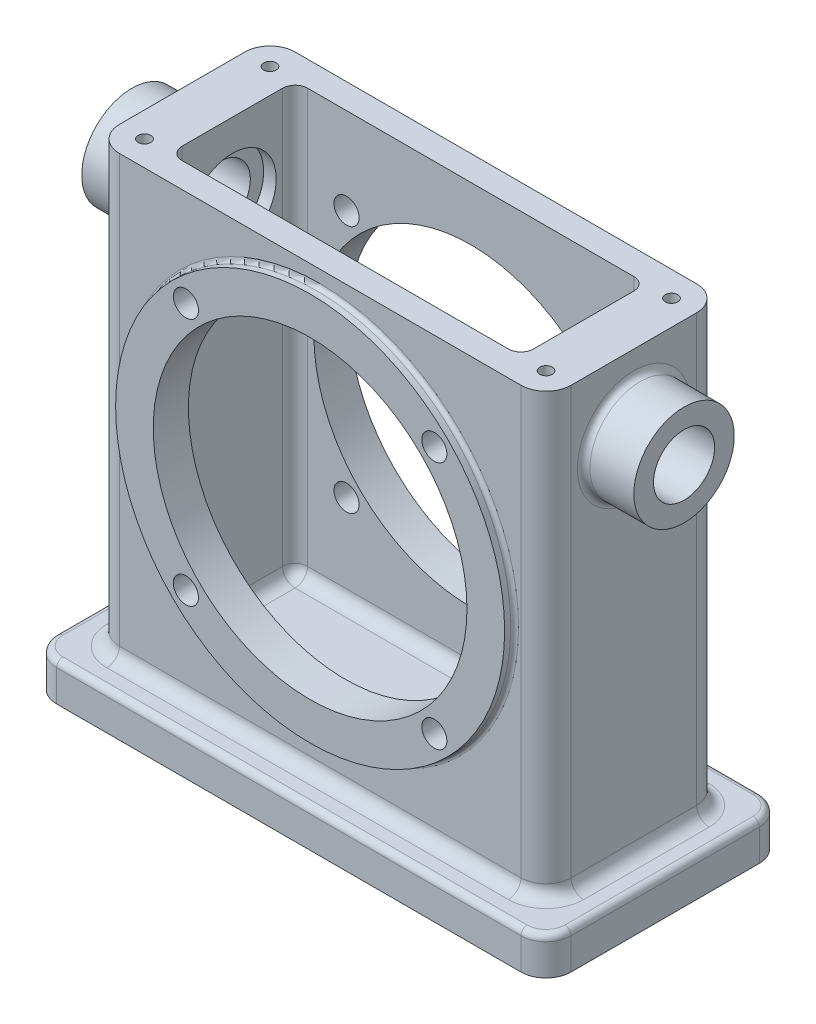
ISO-10303-21;
HEADER;
FILE_DESCRIPTION(('STEP AP214'),'2;1');
FILE_NAME('part.step','',(''),(''),'','','');
FILE_SCHEMA(('AUTOMOTIVE_DESIGN { 1 0 10303 214 1 1 1 1 }'));
ENDSEC;
DATA;
#1=APPLICATION_CONTEXT('core data for automotive mechanical design processes');
#2=APPLICATION_PROTOCOL_DEFINITION('international standard','automotive_design',2000,#1);
#3=PRODUCT_CONTEXT('',#1,'mechanical');
#4=PRODUCT('Part','Part','',(#3));
#5=PRODUCT_RELATED_PRODUCT_CATEGORY('part','',(#4));
#6=PRODUCT_DEFINITION_FORMATION('','',#4);
#7=PRODUCT_DEFINITION_CONTEXT('part definition',#1,'design');
#8=PRODUCT_DEFINITION('design','',#6,#7);
#9=PRODUCT_DEFINITION_SHAPE('','',#8);
#10=(LENGTH_UNIT() NAMED_UNIT(*) SI_UNIT(.MILLI.,.METRE.));
#11=(NAMED_UNIT(*) PLANE_ANGLE_UNIT() SI_UNIT($,.RADIAN.));
#12=(NAMED_UNIT(*) SI_UNIT($,.STERADIAN.) SOLID_ANGLE_UNIT());
#13=UNCERTAINTY_MEASURE_WITH_UNIT(LENGTH_MEASURE(1.E-05),#10,'distance_accuracy_value','');
#14=(GEOMETRIC_REPRESENTATION_CONTEXT(3) GLOBAL_UNCERTAINTY_ASSIGNED_CONTEXT((#13)) GLOBAL_UNIT_ASSIGNED_CONTEXT((#10,
#11,#12)) REPRESENTATION_CONTEXT('',''));
#15=CARTESIAN_POINT('',(0.,0.,0.));
#16=DIRECTION('',(0.,0.,1.));
#17=DIRECTION('',(1.,0.,0.));
#18=AXIS2_PLACEMENT_3D('',#15,#16,#17);
#19=CARTESIAN_POINT('',(-57.15,120.65,22.225));
#20=DIRECTION('',(0.,-1.,0.));
#21=DIRECTION('',(0.,0.,-1.));
#22=AXIS2_PLACEMENT_3D('',#19,#20,#21);
#23=PLANE('',#22);
#24=CARTESIAN_POINT('',(-50.8,120.65,-15.875));
#25=DIRECTION('',(0.,-1.,0.));
#26=DIRECTION('',(0.,0.,1.));
#27=AXIS2_PLACEMENT_3D('',#24,#25,#26);
#28=CIRCLE('',#27,1.5875);
#29=CARTESIAN_POINT('',(-50.8,120.65,-14.2875));
#30=VERTEX_POINT('',#29);
#31=EDGE_CURVE('E580',#30,#30,#28,.T.);
#32=ORIENTED_EDGE('',*,*,#31,.T.);
#33=EDGE_LOOP('',(#32));
#34=FACE_BOUND('',#33,.T.);
#35=CARTESIAN_POINT('',(50.8,120.65,15.875));
#36=DIRECTION('',(0.,1.,0.));
#37=DIRECTION('',(0.,0.,1.));
#38=AXIS2_PLACEMENT_3D('',#35,#36,#37);
#39=CIRCLE('',#38,1.5875);
#40=CARTESIAN_POINT('',(50.8,120.65,17.4625));
#41=VERTEX_POINT('',#40);
#42=EDGE_CURVE('E575',#41,#41,#39,.T.);
#43=ORIENTED_EDGE('',*,*,#42,.F.);
#44=EDGE_LOOP('',(#43));
#45=FACE_BOUND('',#44,.T.);
#46=CARTESIAN_POINT('',(50.8,120.65,-15.875));
#47=DIRECTION('',(0.,1.,0.));
#48=DIRECTION('',(0.,0.,1.));
#49=AXIS2_PLACEMENT_3D('',#46,#47,#48);
#50=CIRCLE('',#49,1.5875);
#51=CARTESIAN_POINT('',(50.8,120.65,-14.2875));
#52=VERTEX_POINT('',#51);
#53=EDGE_CURVE('E574',#52,#52,#50,.T.);
#54=ORIENTED_EDGE('',*,*,#53,.F.);
#55=EDGE_LOOP('',(#54));
#56=FACE_BOUND('',#55,.T.);
#57=DIRECTION('',(0.,0.,-1.));
#58=VECTOR('',#57,1.);
#59=CARTESIAN_POINT('',(44.45,120.65,12.7));
#60=LINE('',#59,#58);
#61=CARTESIAN_POINT('',(44.45,120.65,12.7));
#62=VERTEX_POINT('',#61);
#63=CARTESIAN_POINT('',(44.45,120.65,-12.7));
#64=VERTEX_POINT('',#63);
#65=EDGE_CURVE('E261',#62,#64,#60,.T.);
#66=ORIENTED_EDGE('',*,*,#65,.F.);
#67=CARTESIAN_POINT('',(41.275,120.65,12.7));
#68=DIRECTION('',(0.,1.,0.));
#69=DIRECTION('',(0.,0.,1.));
#70=AXIS2_PLACEMENT_3D('',#67,#68,#69);
#71=CIRCLE('',#70,3.175);
#72=CARTESIAN_POINT('',(41.275,120.65,15.875));
#73=VERTEX_POINT('',#72);
#74=EDGE_CURVE('E266',#73,#62,#71,.T.);
#75=ORIENTED_EDGE('',*,*,#74,.F.);
#76=DIRECTION('',(1.,0.,0.));
#77=VECTOR('',#76,1.);
#78=CARTESIAN_POINT('',(-41.275,120.65,15.875));
#79=LINE('',#78,#77);
#80=CARTESIAN_POINT('',(-41.275,120.65,15.875));
#81=VERTEX_POINT('',#80);
#82=EDGE_CURVE('E285',#81,#73,#79,.T.);
#83=ORIENTED_EDGE('',*,*,#82,.F.);
#84=CARTESIAN_POINT('',(-41.275,120.65,12.7));
#85=DIRECTION('',(0.,1.,0.));
#86=DIRECTION('',(0.,0.,1.));
#87=AXIS2_PLACEMENT_3D('',#84,#85,#86);
#88=CIRCLE('',#87,3.175);
#89=CARTESIAN_POINT('',(-44.45,120.65,12.7));
#90=VERTEX_POINT('',#89);
#91=EDGE_CURVE('E282',#90,#81,#88,.T.);
#92=ORIENTED_EDGE('',*,*,#91,.F.);
#93=DIRECTION('',(0.,0.,1.));
#94=VECTOR('',#93,1.);
#95=CARTESIAN_POINT('',(-44.45,120.65,-12.7));
#96=LINE('',#95,#94);
#97=CARTESIAN_POINT('',(-44.45,120.65,-12.7));
#98=VERTEX_POINT('',#97);
#99=EDGE_CURVE('E279',#98,#90,#96,.T.);
#100=ORIENTED_EDGE('',*,*,#99,.F.);
#101=CARTESIAN_POINT('',(-41.275,120.65,-12.7));
#102=DIRECTION('',(0.,1.,0.));
#103=DIRECTION('',(0.,0.,1.));
#104=AXIS2_PLACEMENT_3D('',#101,#102,#103);
#105=CIRCLE('',#104,3.175);
#106=CARTESIAN_POINT('',(-41.275,120.65,-15.875));
#107=VERTEX_POINT('',#106);
#108=EDGE_CURVE('E273',#107,#98,#105,.T.);
#109=ORIENTED_EDGE('',*,*,#108,.F.);
#110=DIRECTION('',(-1.,0.,0.));
#111=VECTOR('',#110,1.);
#112=CARTESIAN_POINT('',(41.275,120.65,-15.875));
#113=LINE('',#112,#111);
#114=CARTESIAN_POINT('',(41.275,120.65,-15.875));
#115=VERTEX_POINT('',#114);
#116=EDGE_CURVE('E271',#115,#107,#113,.T.);
#117=ORIENTED_EDGE('',*,*,#116,.F.);
#118=CARTESIAN_POINT('',(41.275,120.65,-12.7));
#119=DIRECTION('',(0.,1.,0.));
#120=DIRECTION('',(0.,0.,1.));
#121=AXIS2_PLACEMENT_3D('',#118,#119,#120);
#122=CIRCLE('',#121,3.175);
#123=EDGE_CURVE('E254',#64,#115,#122,.T.);
#124=ORIENTED_EDGE('',*,*,#123,.F.);
#125=EDGE_LOOP('',(#66,#75,#83,#92,#100,#109,#117,#124));
#126=FACE_BOUND('',#125,.T.);
#127=DIRECTION('',(0.,0.,1.));
#128=VECTOR('',#127,1.);
#129=CARTESIAN_POINT('',(-57.15,120.65,22.225));
#130=LINE('',#129,#128);
#131=CARTESIAN_POINT('',(-57.15,120.65,-15.875));
#132=VERTEX_POINT('',#131);
#133=CARTESIAN_POINT('',(-57.15,120.65,15.875));
#134=VERTEX_POINT('',#133);
#135=EDGE_CURVE('E344',#132,#134,#130,.T.);
#136=ORIENTED_EDGE('',*,*,#135,.T.);
#137=CARTESIAN_POINT('',(-50.8,120.65,15.875));
#138=DIRECTION('',(0.,-1.,0.));
#139=DIRECTION('',(0.,0.,-1.));
#140=AXIS2_PLACEMENT_3D('',#137,#138,#139);
#141=CIRCLE('',#140,6.35);
#142=CARTESIAN_POINT('',(-50.8,120.65,22.225));
#143=VERTEX_POINT('',#142);
#144=EDGE_CURVE('E402',#134,#143,#141,.F.);
#145=ORIENTED_EDGE('',*,*,#144,.T.);
#146=DIRECTION('',(1.,0.,0.));
#147=VECTOR('',#146,1.);
#148=CARTESIAN_POINT('',(-57.15,120.65,22.225));
#149=LINE('',#148,#147);
#150=CARTESIAN_POINT('',(50.8,120.65,22.225));
#151=VERTEX_POINT('',#150);
#152=EDGE_CURVE('E347',#143,#151,#149,.T.);
#153=ORIENTED_EDGE('',*,*,#152,.T.);
#154=CARTESIAN_POINT('',(50.8,120.65,15.875));
#155=DIRECTION('',(0.,-1.,0.));
#156=DIRECTION('',(0.,0.,-1.));
#157=AXIS2_PLACEMENT_3D('',#154,#155,#156);
#158=CIRCLE('',#157,6.35);
#159=CARTESIAN_POINT('',(57.15,120.65,15.875));
#160=VERTEX_POINT('',#159);
#161=EDGE_CURVE('E398',#151,#160,#158,.F.);
#162=ORIENTED_EDGE('',*,*,#161,.T.);
#163=DIRECTION('',(0.,0.,-1.));
#164=VECTOR('',#163,1.);
#165=CARTESIAN_POINT('',(57.15,120.65,22.225));
#166=LINE('',#165,#164);
#167=CARTESIAN_POINT('',(57.15,120.65,-15.875));
#168=VERTEX_POINT('',#167);
#169=EDGE_CURVE('E350',#160,#168,#166,.T.);
#170=ORIENTED_EDGE('',*,*,#169,.T.);
#171=CARTESIAN_POINT('',(50.8,120.65,-15.875));
#172=DIRECTION('',(0.,-1.,0.));
#173=DIRECTION('',(0.,0.,-1.));
#174=AXIS2_PLACEMENT_3D('',#171,#172,#173);
#175=CIRCLE('',#174,6.35);
#176=CARTESIAN_POINT('',(50.8,120.65,-22.225));
#177=VERTEX_POINT('',#176);
#178=EDGE_CURVE('E396',#168,#177,#175,.F.);
#179=ORIENTED_EDGE('',*,*,#178,.T.);
#180=DIRECTION('',(-1.,0.,0.));
#181=VECTOR('',#180,1.);
#182=CARTESIAN_POINT('',(-57.15,120.65,-22.225));
#183=LINE('',#182,#181);
#184=CARTESIAN_POINT('',(-50.8,120.65,-22.225));
#185=VERTEX_POINT('',#184);
#186=EDGE_CURVE('E353',#177,#185,#183,.T.);
#187=ORIENTED_EDGE('',*,*,#186,.T.);
#188=CARTESIAN_POINT('',(-50.8,120.65,-15.875));
#189=DIRECTION('',(0.,-1.,0.));
#190=DIRECTION('',(0.,0.,-1.));
#191=AXIS2_PLACEMENT_3D('',#188,#189,#190);
#192=CIRCLE('',#191,6.35);
#193=EDGE_CURVE('E400',#185,#132,#192,.F.);
#194=ORIENTED_EDGE('',*,*,#193,.T.);
#195=EDGE_LOOP('',(#136,#145,#153,#162,#170,#179,#187,#194));
#196=FACE_BOUND('',#195,.T.);
#197=CARTESIAN_POINT('',(-50.8,120.65,15.875));
#198=DIRECTION('',(0.,-1.,0.));
#199=DIRECTION('',(0.,0.,1.));
#200=AXIS2_PLACEMENT_3D('',#197,#198,#199);
#201=CIRCLE('',#200,1.5875);
#202=CARTESIAN_POINT('',(-50.8,120.65,17.4625));
#203=VERTEX_POINT('',#202);
#204=EDGE_CURVE('E581',#203,#203,#201,.T.);
#205=ORIENTED_EDGE('',*,*,#204,.T.);
#206=EDGE_LOOP('',(#205));
#207=FACE_BOUND('',#206,.T.);
#208=ADVANCED_FACE('F28',(#34,#45,#56,#126,#196,#207),#23,.F.);
#209=CARTESIAN_POINT('',(-44.45,12.7,-12.7));
#210=DIRECTION('',(-1.,0.,0.));
#211=DIRECTION('',(0.,0.,1.));
#212=AXIS2_PLACEMENT_3D('',#209,#210,#211);
#213=PLANE('',#212);
#214=DIRECTION('',(0.,1.,0.));
#215=VECTOR('',#214,1.);
#216=CARTESIAN_POINT('',(-44.45,12.7,12.7));
#217=LINE('',#216,#215);
#218=CARTESIAN_POINT('',(-44.45,15.875,12.7));
#219=VERTEX_POINT('',#218);
#220=EDGE_CURVE('E293',#219,#90,#217,.T.);
#221=ORIENTED_EDGE('',*,*,#220,.F.);
#222=DIRECTION('',(0.,0.,1.));
#223=VECTOR('',#222,1.);
#224=CARTESIAN_POINT('',(-44.45,15.875,-12.7));
#225=LINE('',#224,#223);
#226=CARTESIAN_POINT('',(-44.45,15.875,-12.7));
#227=VERTEX_POINT('',#226);
#228=EDGE_CURVE('E506',#219,#227,#225,.F.);
#229=ORIENTED_EDGE('',*,*,#228,.T.);
#230=DIRECTION('',(0.,1.,0.));
#231=VECTOR('',#230,1.);
#232=CARTESIAN_POINT('',(-44.45,12.7,-12.7));
#233=LINE('',#232,#231);
#234=EDGE_CURVE('E295',#227,#98,#233,.T.);
#235=ORIENTED_EDGE('',*,*,#234,.T.);
#236=ORIENTED_EDGE('',*,*,#99,.T.);
#237=EDGE_LOOP('',(#221,#229,#235,#236));
#238=FACE_BOUND('',#237,.T.);
#239=CARTESIAN_POINT('',(-44.45,101.6,0.));
#240=DIRECTION('',(-1.,0.,0.));
#241=DIRECTION('',(0.,0.,1.));
#242=AXIS2_PLACEMENT_3D('',#239,#240,#241);
#243=CIRCLE('',#242,11.1125);
#244=CARTESIAN_POINT('',(-44.45,101.6,11.1125));
#245=VERTEX_POINT('',#244);
#246=EDGE_CURVE('E623',#245,#245,#243,.T.);
#247=ORIENTED_EDGE('',*,*,#246,.T.);
#248=EDGE_LOOP('',(#247));
#249=FACE_BOUND('',#248,.T.);
#250=ADVANCED_FACE('F694',(#238,#249),#213,.F.);
#251=CARTESIAN_POINT('',(-69.85,101.6,0.));
#252=DIRECTION('',(1.,0.,0.));
#253=DIRECTION('',(0.,0.,-1.));
#254=AXIS2_PLACEMENT_3D('',#251,#252,#253);
#255=CYLINDRICAL_SURFACE('',#254,7.7343);
#256=CARTESIAN_POINT('',(-69.85,101.6,0.));
#257=DIRECTION('',(-1.,0.,0.));
#258=DIRECTION('',(0.,0.,1.));
#259=AXIS2_PLACEMENT_3D('',#256,#257,#258);
#260=CIRCLE('',#259,7.7343);
#261=CARTESIAN_POINT('',(-69.85,101.6,7.73429999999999));
#262=VERTEX_POINT('',#261);
#263=EDGE_CURVE('E542',#262,#262,#260,.T.);
#264=ORIENTED_EDGE('',*,*,#263,.T.);
#265=EDGE_LOOP('',(#264));
#266=FACE_BOUND('',#265,.T.);
#267=CARTESIAN_POINT('',(-47.625,101.6,0.));
#268=DIRECTION('',(1.,0.,0.));
#269=DIRECTION('',(0.,0.,-1.));
#270=AXIS2_PLACEMENT_3D('',#267,#268,#269);
#271=CIRCLE('',#270,7.7343);
#272=CARTESIAN_POINT('',(-47.625,101.6,-7.7343));
#273=VERTEX_POINT('',#272);
#274=EDGE_CURVE('E539',#273,#273,#271,.T.);
#275=ORIENTED_EDGE('',*,*,#274,.T.);
#276=EDGE_LOOP('',(#275));
#277=FACE_BOUND('',#276,.T.);
#278=ADVANCED_FACE('F748',(#266,#277),#255,.F.);
#279=CARTESIAN_POINT('',(-69.85,101.6,0.));
#280=DIRECTION('',(-1.,0.,0.));
#281=DIRECTION('',(0.,0.,-1.));
#282=AXIS2_PLACEMENT_3D('',#279,#280,#281);
#283=PLANE('',#282);
#284=CARTESIAN_POINT('',(-69.85,101.6,0.));
#285=DIRECTION('',(1.,0.,0.));
#286=DIRECTION('',(0.,0.,-1.));
#287=AXIS2_PLACEMENT_3D('',#284,#285,#286);
#288=CIRCLE('',#287,12.7);
#289=CARTESIAN_POINT('',(-69.85,101.6,-12.7));
#290=VERTEX_POINT('',#289);
#291=EDGE_CURVE('E630',#290,#290,#288,.T.);
#292=ORIENTED_EDGE('',*,*,#291,.F.);
#293=EDGE_LOOP('',(#292));
#294=FACE_BOUND('',#293,.T.);
#295=ORIENTED_EDGE('',*,*,#263,.F.);
#296=EDGE_LOOP('',(#295));
#297=FACE_BOUND('',#296,.T.);
#298=ADVANCED_FACE('F867',(#294,#297),#283,.T.);
#299=CARTESIAN_POINT('',(69.85,101.6,0.));
#300=DIRECTION('',(-1.,0.,0.));
#301=DIRECTION('',(0.,0.,1.));
#302=AXIS2_PLACEMENT_3D('',#299,#300,#301);
#303=CYLINDRICAL_SURFACE('',#302,7.7343);
#304=CARTESIAN_POINT('',(69.85,101.6,0.));
#305=DIRECTION('',(-1.,0.,0.));
#306=DIRECTION('',(0.,0.,1.));
#307=AXIS2_PLACEMENT_3D('',#304,#305,#306);
#308=CIRCLE('',#307,7.7343);
#309=CARTESIAN_POINT('',(69.85,101.6,7.73429999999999));
#310=VERTEX_POINT('',#309);
#311=EDGE_CURVE('E537',#310,#310,#308,.T.);
#312=ORIENTED_EDGE('',*,*,#311,.F.);
#313=EDGE_LOOP('',(#312));
#314=FACE_BOUND('',#313,.T.);
#315=CARTESIAN_POINT('',(47.625,101.6,0.));
#316=DIRECTION('',(-1.,0.,0.));
#317=DIRECTION('',(0.,0.,1.));
#318=AXIS2_PLACEMENT_3D('',#315,#316,#317);
#319=CIRCLE('',#318,7.7343);
#320=CARTESIAN_POINT('',(47.625,101.6,7.73429999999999));
#321=VERTEX_POINT('',#320);
#322=EDGE_CURVE('E534',#321,#321,#319,.F.);
#323=ORIENTED_EDGE('',*,*,#322,.F.);
#324=EDGE_LOOP('',(#323));
#325=FACE_BOUND('',#324,.T.);
#326=ADVANCED_FACE('F764',(#314,#325),#303,.F.);
#327=CARTESIAN_POINT('',(57.15,120.65,22.225));
#328=DIRECTION('',(-1.,0.,0.));
#329=DIRECTION('',(0.,0.,1.));
#330=AXIS2_PLACEMENT_3D('',#327,#328,#329);
#331=PLANE('',#330);
#332=CARTESIAN_POINT('',(57.15,101.6,0.));
#333=DIRECTION('',(-1.,0.,0.));
#334=DIRECTION('',(0.,0.,1.));
#335=AXIS2_PLACEMENT_3D('',#332,#333,#334);
#336=CIRCLE('',#335,14.2875);
#337=CARTESIAN_POINT('',(57.15,101.6,14.2875));
#338=VERTEX_POINT('',#337);
#339=EDGE_CURVE('E11',#338,#338,#336,.T.);
#340=ORIENTED_EDGE('',*,*,#339,.T.);
#341=EDGE_LOOP('',(#340));
#342=FACE_BOUND('',#341,.T.);
#343=DIRECTION('',(0.,-1.,0.));
#344=VECTOR('',#343,1.);
#345=CARTESIAN_POINT('',(57.15,120.65,15.875));
#346=LINE('',#345,#344);
#347=CARTESIAN_POINT('',(57.15,12.7,15.875));
#348=VERTEX_POINT('',#347);
#349=EDGE_CURVE('E411',#160,#348,#346,.T.);
#350=ORIENTED_EDGE('',*,*,#349,.T.);
#351=DIRECTION('',(0.,0.,-1.));
#352=VECTOR('',#351,1.);
#353=CARTESIAN_POINT('',(57.15,12.7,-15.875));
#354=LINE('',#353,#352);
#355=CARTESIAN_POINT('',(57.15,12.7,-15.875));
#356=VERTEX_POINT('',#355);
#357=EDGE_CURVE('E484',#348,#356,#354,.T.);
#358=ORIENTED_EDGE('',*,*,#357,.T.);
#359=DIRECTION('',(0.,-1.,0.));
#360=VECTOR('',#359,1.);
#361=CARTESIAN_POINT('',(57.15,120.65,-15.875));
#362=LINE('',#361,#360);
#363=EDGE_CURVE('E409',#356,#168,#362,.F.);
#364=ORIENTED_EDGE('',*,*,#363,.T.);
#365=ORIENTED_EDGE('',*,*,#169,.F.);
#366=EDGE_LOOP('',(#350,#358,#364,#365));
#367=FACE_BOUND('',#366,.T.);
#368=ADVANCED_FACE('F760',(#342,#367),#331,.F.);
#369=CARTESIAN_POINT('',(-57.15,120.65,22.225));
#370=DIRECTION('',(0.,0.,-1.));
#371=DIRECTION('',(-1.,0.,0.));
#372=AXIS2_PLACEMENT_3D('',#369,#370,#371);
#373=PLANE('',#372);
#374=CARTESIAN_POINT('',(0.,67.31,22.225));
#375=DIRECTION('',(0.,0.,-1.));
#376=DIRECTION('',(-1.,0.,0.));
#377=AXIS2_PLACEMENT_3D('',#374,#375,#376);
#378=CIRCLE('',#377,50.2031);
#379=CARTESIAN_POINT('',(-50.2031,67.31,22.225));
#380=VERTEX_POINT('',#379);
#381=EDGE_CURVE('E524',#380,#380,#378,.T.);
#382=ORIENTED_EDGE('',*,*,#381,.T.);
#383=EDGE_LOOP('',(#382));
#384=FACE_BOUND('',#383,.T.);
#385=DIRECTION('',(0.,-1.,0.));
#386=VECTOR('',#385,1.);
#387=CARTESIAN_POINT('',(-50.8,120.65,22.225));
#388=LINE('',#387,#386);
#389=CARTESIAN_POINT('',(-50.8,12.7,22.225));
#390=VERTEX_POINT('',#389);
#391=EDGE_CURVE('E388',#143,#390,#388,.T.);
#392=ORIENTED_EDGE('',*,*,#391,.T.);
#393=DIRECTION('',(1.,0.,0.));
#394=VECTOR('',#393,1.);
#395=CARTESIAN_POINT('',(50.8,12.7,22.225));
#396=LINE('',#395,#394);
#397=CARTESIAN_POINT('',(50.8,12.7,22.225));
#398=VERTEX_POINT('',#397);
#399=EDGE_CURVE('E490',#390,#398,#396,.T.);
#400=ORIENTED_EDGE('',*,*,#399,.T.);
#401=DIRECTION('',(0.,-1.,0.));
#402=VECTOR('',#401,1.);
#403=CARTESIAN_POINT('',(50.8,120.65,22.225));
#404=LINE('',#403,#402);
#405=EDGE_CURVE('E386',#398,#151,#404,.F.);
#406=ORIENTED_EDGE('',*,*,#405,.T.);
#407=ORIENTED_EDGE('',*,*,#152,.F.);
#408=EDGE_LOOP('',(#392,#400,#406,#407));
#409=FACE_BOUND('',#408,.T.);
#410=ADVANCED_FACE('F763',(#384,#409),#373,.F.);
#411=CARTESIAN_POINT('',(-65.0875,9.525,-30.1625));
#412=DIRECTION('',(0.,-1.,0.));
#413=DIRECTION('',(0.,0.,-1.));
#414=AXIS2_PLACEMENT_3D('',#411,#412,#413);
#415=PLANE('',#414);
#416=CARTESIAN_POINT('',(-50.8,9.525,-15.875));
#417=DIRECTION('',(0.,-1.,0.));
#418=DIRECTION('',(0.,0.,-1.));
#419=AXIS2_PLACEMENT_3D('',#416,#417,#418);
#420=CIRCLE('',#419,9.525);
#421=CARTESIAN_POINT('',(-60.325,9.525,-15.875));
#422=VERTEX_POINT('',#421);
#423=CARTESIAN_POINT('',(-50.8,9.525,-25.4));
#424=VERTEX_POINT('',#423);
#425=EDGE_CURVE('E473',#422,#424,#420,.T.);
#426=ORIENTED_EDGE('',*,*,#425,.T.);
#427=DIRECTION('',(-1.,0.,0.));
#428=VECTOR('',#427,1.);
#429=CARTESIAN_POINT('',(50.8,9.525,-25.4));
#430=LINE('',#429,#428);
#431=CARTESIAN_POINT('',(50.8,9.525,-25.4));
#432=VERTEX_POINT('',#431);
#433=EDGE_CURVE('E475',#424,#432,#430,.F.);
#434=ORIENTED_EDGE('',*,*,#433,.T.);
#435=CARTESIAN_POINT('',(50.8,9.525,-15.875));
#436=DIRECTION('',(0.,-1.,0.));
#437=DIRECTION('',(0.,0.,-1.));
#438=AXIS2_PLACEMENT_3D('',#435,#436,#437);
#439=CIRCLE('',#438,9.525);
#440=CARTESIAN_POINT('',(60.325,9.525,-15.875));
#441=VERTEX_POINT('',#440);
#442=EDGE_CURVE('E471',#432,#441,#439,.T.);
#443=ORIENTED_EDGE('',*,*,#442,.T.);
#444=DIRECTION('',(0.,0.,-1.));
#445=VECTOR('',#444,1.);
#446=CARTESIAN_POINT('',(60.325,9.525,15.875));
#447=LINE('',#446,#445);
#448=CARTESIAN_POINT('',(60.325,9.525,15.875));
#449=VERTEX_POINT('',#448);
#450=EDGE_CURVE('E467',#441,#449,#447,.F.);
#451=ORIENTED_EDGE('',*,*,#450,.T.);
#452=CARTESIAN_POINT('',(50.8,9.525,15.875));
#453=DIRECTION('',(0.,-1.,0.));
#454=DIRECTION('',(0.,0.,-1.));
#455=AXIS2_PLACEMENT_3D('',#452,#453,#454);
#456=CIRCLE('',#455,9.525);
#457=CARTESIAN_POINT('',(50.8,9.525,25.4));
#458=VERTEX_POINT('',#457);
#459=EDGE_CURVE('E463',#449,#458,#456,.T.);
#460=ORIENTED_EDGE('',*,*,#459,.T.);
#461=DIRECTION('',(1.,0.,0.));
#462=VECTOR('',#461,1.);
#463=CARTESIAN_POINT('',(-50.8,9.525,25.4));
#464=LINE('',#463,#462);
#465=CARTESIAN_POINT('',(-50.8,9.525,25.4));
#466=VERTEX_POINT('',#465);
#467=EDGE_CURVE('E461',#458,#466,#464,.F.);
#468=ORIENTED_EDGE('',*,*,#467,.T.);
#469=CARTESIAN_POINT('',(-50.8,9.525,15.875));
#470=DIRECTION('',(0.,-1.,0.));
#471=DIRECTION('',(0.,0.,-1.));
#472=AXIS2_PLACEMENT_3D('',#469,#470,#471);
#473=CIRCLE('',#472,9.525);
#474=CARTESIAN_POINT('',(-60.325,9.525,15.875));
#475=VERTEX_POINT('',#474);
#476=EDGE_CURVE('E465',#466,#475,#473,.T.);
#477=ORIENTED_EDGE('',*,*,#476,.T.);
#478=DIRECTION('',(0.,0.,1.));
#479=VECTOR('',#478,1.);
#480=CARTESIAN_POINT('',(-60.325,9.525,-15.875));
#481=LINE('',#480,#479);
#482=EDGE_CURVE('E469',#475,#422,#481,.F.);
#483=ORIENTED_EDGE('',*,*,#482,.T.);
#484=EDGE_LOOP('',(#426,#434,#443,#451,#460,#468,#477,#483));
#485=FACE_BOUND('',#484,.T.);
#486=CARTESIAN_POINT('',(-58.7375,9.525,23.8125));
#487=DIRECTION('',(0.,-1.,0.));
#488=DIRECTION('',(0.,0.,-1.));
#489=AXIS2_PLACEMENT_3D('',#486,#487,#488);
#490=CIRCLE('',#489,4.7625);
#491=CARTESIAN_POINT('',(-63.5,9.525,23.8125));
#492=VERTEX_POINT('',#491);
#493=CARTESIAN_POINT('',(-58.7375,9.525,28.575));
#494=VERTEX_POINT('',#493);
#495=EDGE_CURVE('E434',#492,#494,#490,.F.);
#496=ORIENTED_EDGE('',*,*,#495,.T.);
#497=DIRECTION('',(1.,0.,0.));
#498=VECTOR('',#497,1.);
#499=CARTESIAN_POINT('',(-65.0875,9.525,28.575));
#500=LINE('',#499,#498);
#501=CARTESIAN_POINT('',(58.7375,9.525,28.575));
#502=VERTEX_POINT('',#501);
#503=EDGE_CURVE('E438',#494,#502,#500,.T.);
#504=ORIENTED_EDGE('',*,*,#503,.T.);
#505=CARTESIAN_POINT('',(58.7375,9.525,23.8125));
#506=DIRECTION('',(0.,-1.,0.));
#507=DIRECTION('',(0.,0.,-1.));
#508=AXIS2_PLACEMENT_3D('',#505,#506,#507);
#509=CIRCLE('',#508,4.7625);
#510=CARTESIAN_POINT('',(63.5,9.525,23.8125));
#511=VERTEX_POINT('',#510);
#512=EDGE_CURVE('E436',#502,#511,#509,.F.);
#513=ORIENTED_EDGE('',*,*,#512,.T.);
#514=DIRECTION('',(0.,0.,-1.));
#515=VECTOR('',#514,1.);
#516=CARTESIAN_POINT('',(63.5,9.525,-30.1625));
#517=LINE('',#516,#515);
#518=CARTESIAN_POINT('',(63.5,9.525,-23.8125));
#519=VERTEX_POINT('',#518);
#520=EDGE_CURVE('E432',#511,#519,#517,.T.);
#521=ORIENTED_EDGE('',*,*,#520,.T.);
#522=CARTESIAN_POINT('',(58.7375,9.525,-23.8125));
#523=DIRECTION('',(0.,-1.,0.));
#524=DIRECTION('',(0.,0.,-1.));
#525=AXIS2_PLACEMENT_3D('',#522,#523,#524);
#526=CIRCLE('',#525,4.7625);
#527=CARTESIAN_POINT('',(58.7375,9.525,-28.575));
#528=VERTEX_POINT('',#527);
#529=EDGE_CURVE('E428',#519,#528,#526,.F.);
#530=ORIENTED_EDGE('',*,*,#529,.T.);
#531=DIRECTION('',(-1.,0.,0.));
#532=VECTOR('',#531,1.);
#533=CARTESIAN_POINT('',(-65.0875,9.525,-28.575));
#534=LINE('',#533,#532);
#535=CARTESIAN_POINT('',(-58.7375,9.525,-28.575));
#536=VERTEX_POINT('',#535);
#537=EDGE_CURVE('E424',#528,#536,#534,.T.);
#538=ORIENTED_EDGE('',*,*,#537,.T.);
#539=CARTESIAN_POINT('',(-58.7375,9.525,-23.8125));
#540=DIRECTION('',(0.,-1.,0.));
#541=DIRECTION('',(0.,0.,-1.));
#542=AXIS2_PLACEMENT_3D('',#539,#540,#541);
#543=CIRCLE('',#542,4.7625);
#544=CARTESIAN_POINT('',(-63.5,9.525,-23.8125));
#545=VERTEX_POINT('',#544);
#546=EDGE_CURVE('E426',#536,#545,#543,.F.);
#547=ORIENTED_EDGE('',*,*,#546,.T.);
#548=DIRECTION('',(0.,0.,1.));
#549=VECTOR('',#548,1.);
#550=CARTESIAN_POINT('',(-63.5,9.525,-30.1625));
#551=LINE('',#550,#549);
#552=EDGE_CURVE('E430',#545,#492,#551,.T.);
#553=ORIENTED_EDGE('',*,*,#552,.T.);
#554=EDGE_LOOP('',(#496,#504,#513,#521,#530,#538,#547,#553));
#555=FACE_BOUND('',#554,.T.);
#556=ADVANCED_FACE('F768',(#485,#555),#415,.F.);
#557=CARTESIAN_POINT('',(-65.0875,9.525,30.1625));
#558=DIRECTION('',(1.,0.,0.));
#559=DIRECTION('',(0.,0.,-1.));
#560=AXIS2_PLACEMENT_3D('',#557,#558,#559);
#561=PLANE('',#560);
#562=DIRECTION('',(0.,-1.,0.));
#563=VECTOR('',#562,1.);
#564=CARTESIAN_POINT('',(-65.0875,9.525,23.8125));
#565=LINE('',#564,#563);
#566=CARTESIAN_POINT('',(-65.0875,0.,23.8125));
#567=VERTEX_POINT('',#566);
#568=CARTESIAN_POINT('',(-65.0875,7.9375,23.8125));
#569=VERTEX_POINT('',#568);
#570=EDGE_CURVE('E383',#567,#569,#565,.F.);
#571=ORIENTED_EDGE('',*,*,#570,.T.);
#572=DIRECTION('',(0.,0.,1.));
#573=VECTOR('',#572,1.);
#574=CARTESIAN_POINT('',(-65.0875,7.9375,30.1625));
#575=LINE('',#574,#573);
#576=CARTESIAN_POINT('',(-65.0875,7.9375,-23.8125));
#577=VERTEX_POINT('',#576);
#578=EDGE_CURVE('E450',#569,#577,#575,.F.);
#579=ORIENTED_EDGE('',*,*,#578,.T.);
#580=DIRECTION('',(0.,-1.,0.));
#581=VECTOR('',#580,1.);
#582=CARTESIAN_POINT('',(-65.0875,9.525,-23.8125));
#583=LINE('',#582,#581);
#584=CARTESIAN_POINT('',(-65.0875,0.,-23.8125));
#585=VERTEX_POINT('',#584);
#586=EDGE_CURVE('E381',#577,#585,#583,.T.);
#587=ORIENTED_EDGE('',*,*,#586,.T.);
#588=DIRECTION('',(0.,0.,1.));
#589=VECTOR('',#588,1.);
#590=CARTESIAN_POINT('',(-65.0875,0.,30.1625));
#591=LINE('',#590,#589);
#592=EDGE_CURVE('E356',#585,#567,#591,.T.);
#593=ORIENTED_EDGE('',*,*,#592,.T.);
#594=EDGE_LOOP('',(#571,#579,#587,#593));
#595=FACE_BOUND('',#594,.T.);
#596=ADVANCED_FACE('F780',(#595),#561,.F.);
#597=CARTESIAN_POINT('',(-65.0875,9.525,30.1625));
#598=DIRECTION('',(0.,0.,-1.));
#599=DIRECTION('',(-1.,0.,0.));
#600=AXIS2_PLACEMENT_3D('',#597,#598,#599);
#601=PLANE('',#600);
#602=DIRECTION('',(0.,-1.,0.));
#603=VECTOR('',#602,1.);
#604=CARTESIAN_POINT('',(58.7375,9.525,30.1625));
#605=LINE('',#604,#603);
#606=CARTESIAN_POINT('',(58.7375,0.,30.1625));
#607=VERTEX_POINT('',#606);
#608=CARTESIAN_POINT('',(58.7375,7.9375,30.1625));
#609=VERTEX_POINT('',#608);
#610=EDGE_CURVE('E368',#607,#609,#605,.F.);
#611=ORIENTED_EDGE('',*,*,#610,.T.);
#612=DIRECTION('',(1.,0.,0.));
#613=VECTOR('',#612,1.);
#614=CARTESIAN_POINT('',(-65.0875,7.9375,30.1625));
#615=LINE('',#614,#613);
#616=CARTESIAN_POINT('',(-58.7375,7.9375,30.1625));
#617=VERTEX_POINT('',#616);
#618=EDGE_CURVE('E441',#609,#617,#615,.F.);
#619=ORIENTED_EDGE('',*,*,#618,.T.);
#620=DIRECTION('',(0.,-1.,0.));
#621=VECTOR('',#620,1.);
#622=CARTESIAN_POINT('',(-58.7375,9.525,30.1625));
#623=LINE('',#622,#621);
#624=CARTESIAN_POINT('',(-58.7375,0.,30.1625));
#625=VERTEX_POINT('',#624);
#626=EDGE_CURVE('E371',#617,#625,#623,.T.);
#627=ORIENTED_EDGE('',*,*,#626,.T.);
#628=DIRECTION('',(1.,0.,0.));
#629=VECTOR('',#628,1.);
#630=CARTESIAN_POINT('',(-65.0875,0.,30.1625));
#631=LINE('',#630,#629);
#632=EDGE_CURVE('E359',#625,#607,#631,.T.);
#633=ORIENTED_EDGE('',*,*,#632,.T.);
#634=EDGE_LOOP('',(#611,#619,#627,#633));
#635=FACE_BOUND('',#634,.T.);
#636=ADVANCED_FACE('F788',(#635),#601,.F.);
#637=CARTESIAN_POINT('',(65.0875,9.525,30.1625));
#638=DIRECTION('',(-1.,0.,0.));
#639=DIRECTION('',(0.,0.,1.));
#640=AXIS2_PLACEMENT_3D('',#637,#638,#639);
#641=PLANE('',#640);
#642=DIRECTION('',(0.,-1.,0.));
#643=VECTOR('',#642,1.);
#644=CARTESIAN_POINT('',(65.0875,9.525,-23.8125));
#645=LINE('',#644,#643);
#646=CARTESIAN_POINT('',(65.0875,0.,-23.8125));
#647=VERTEX_POINT('',#646);
#648=CARTESIAN_POINT('',(65.0875,7.9375,-23.8125));
#649=VERTEX_POINT('',#648);
#650=EDGE_CURVE('E421',#647,#649,#645,.F.);
#651=ORIENTED_EDGE('',*,*,#650,.T.);
#652=DIRECTION('',(0.,0.,-1.));
#653=VECTOR('',#652,1.);
#654=CARTESIAN_POINT('',(65.0875,7.9375,30.1625));
#655=LINE('',#654,#653);
#656=CARTESIAN_POINT('',(65.0875,7.9375,23.8125));
#657=VERTEX_POINT('',#656);
#658=EDGE_CURVE('E448',#649,#657,#655,.F.);
#659=ORIENTED_EDGE('',*,*,#658,.T.);
#660=DIRECTION('',(0.,-1.,0.));
#661=VECTOR('',#660,1.);
#662=CARTESIAN_POINT('',(65.0875,9.525,23.8125));
#663=LINE('',#662,#661);
#664=CARTESIAN_POINT('',(65.0875,0.,23.8125));
#665=VERTEX_POINT('',#664);
#666=EDGE_CURVE('E419',#657,#665,#663,.T.);
#667=ORIENTED_EDGE('',*,*,#666,.T.);
#668=DIRECTION('',(0.,0.,-1.));
#669=VECTOR('',#668,1.);
#670=CARTESIAN_POINT('',(65.0875,0.,30.1625));
#671=LINE('',#670,#669);
#672=EDGE_CURVE('E362',#665,#647,#671,.T.);
#673=ORIENTED_EDGE('',*,*,#672,.T.);
#674=EDGE_LOOP('',(#651,#659,#667,#673));
#675=FACE_BOUND('',#674,.T.);
#676=ADVANCED_FACE('F784',(#675),#641,.F.);
#677=CARTESIAN_POINT('',(-65.0875,9.525,-30.1625));
#678=DIRECTION('',(0.,0.,1.));
#679=DIRECTION('',(1.,0.,0.));
#680=AXIS2_PLACEMENT_3D('',#677,#678,#679);
#681=PLANE('',#680);
#682=DIRECTION('',(0.,-1.,0.));
#683=VECTOR('',#682,1.);
#684=CARTESIAN_POINT('',(-58.7375,9.525,-30.1625));
#685=LINE('',#684,#683);
#686=CARTESIAN_POINT('',(-58.7375,0.,-30.1625));
#687=VERTEX_POINT('',#686);
#688=CARTESIAN_POINT('',(-58.7375,7.9375,-30.1625));
#689=VERTEX_POINT('',#688);
#690=EDGE_CURVE('E414',#687,#689,#685,.F.);
#691=ORIENTED_EDGE('',*,*,#690,.T.);
#692=DIRECTION('',(-1.,0.,0.));
#693=VECTOR('',#692,1.);
#694=CARTESIAN_POINT('',(-65.0875,7.9375,-30.1625));
#695=LINE('',#694,#693);
#696=CARTESIAN_POINT('',(58.7375,7.9375,-30.1625));
#697=VERTEX_POINT('',#696);
#698=EDGE_CURVE('E456',#689,#697,#695,.F.);
#699=ORIENTED_EDGE('',*,*,#698,.T.);
#700=DIRECTION('',(0.,-1.,0.));
#701=VECTOR('',#700,1.);
#702=CARTESIAN_POINT('',(58.7375,9.525,-30.1625));
#703=LINE('',#702,#701);
#704=CARTESIAN_POINT('',(58.7375,0.,-30.1625));
#705=VERTEX_POINT('',#704);
#706=EDGE_CURVE('E417',#697,#705,#703,.T.);
#707=ORIENTED_EDGE('',*,*,#706,.T.);
#708=DIRECTION('',(-1.,0.,0.));
#709=VECTOR('',#708,1.);
#710=CARTESIAN_POINT('',(-65.0875,0.,-30.1625));
#711=LINE('',#710,#709);
#712=EDGE_CURVE('E365',#705,#687,#711,.T.);
#713=ORIENTED_EDGE('',*,*,#712,.T.);
#714=EDGE_LOOP('',(#691,#699,#707,#713));
#715=FACE_BOUND('',#714,.T.);
#716=ADVANCED_FACE('F776',(#715),#681,.F.);
#717=CARTESIAN_POINT('',(-65.0875,0.,-30.1625));
#718=DIRECTION('',(0.,-1.,0.));
#719=DIRECTION('',(0.,0.,-1.));
#720=AXIS2_PLACEMENT_3D('',#717,#718,#719);
#721=PLANE('',#720);
#722=ORIENTED_EDGE('',*,*,#632,.F.);
#723=CARTESIAN_POINT('',(-58.7375,0.,23.8125));
#724=DIRECTION('',(0.,-1.,0.));
#725=DIRECTION('',(0.,0.,-1.));
#726=AXIS2_PLACEMENT_3D('',#723,#724,#725);
#727=CIRCLE('',#726,6.35);
#728=EDGE_CURVE('E379',#625,#567,#727,.T.);
#729=ORIENTED_EDGE('',*,*,#728,.T.);
#730=ORIENTED_EDGE('',*,*,#592,.F.);
#731=CARTESIAN_POINT('',(-58.7375,0.,-23.8125));
#732=DIRECTION('',(0.,-1.,0.));
#733=DIRECTION('',(0.,0.,-1.));
#734=AXIS2_PLACEMENT_3D('',#731,#732,#733);
#735=CIRCLE('',#734,6.35);
#736=EDGE_CURVE('E373',#585,#687,#735,.T.);
#737=ORIENTED_EDGE('',*,*,#736,.T.);
#738=ORIENTED_EDGE('',*,*,#712,.F.);
#739=CARTESIAN_POINT('',(58.7375,0.,-23.8125));
#740=DIRECTION('',(0.,-1.,0.));
#741=DIRECTION('',(0.,0.,-1.));
#742=AXIS2_PLACEMENT_3D('',#739,#740,#741);
#743=CIRCLE('',#742,6.35);
#744=EDGE_CURVE('E377',#705,#647,#743,.T.);
#745=ORIENTED_EDGE('',*,*,#744,.T.);
#746=ORIENTED_EDGE('',*,*,#672,.F.);
#747=CARTESIAN_POINT('',(58.7375,0.,23.8125));
#748=DIRECTION('',(0.,-1.,0.));
#749=DIRECTION('',(0.,0.,-1.));
#750=AXIS2_PLACEMENT_3D('',#747,#748,#749);
#751=CIRCLE('',#750,6.35);
#752=EDGE_CURVE('E375',#665,#607,#751,.T.);
#753=ORIENTED_EDGE('',*,*,#752,.T.);
#754=EDGE_LOOP('',(#722,#729,#730,#737,#738,#745,#746,#753));
#755=FACE_BOUND('',#754,.T.);
#756=ADVANCED_FACE('F772',(#755),#721,.T.);
#757=CARTESIAN_POINT('',(-57.15,120.65,22.225));
#758=DIRECTION('',(1.,0.,0.));
#759=DIRECTION('',(0.,0.,-1.));
#760=AXIS2_PLACEMENT_3D('',#757,#758,#759);
#761=PLANE('',#760);
#762=CARTESIAN_POINT('',(-57.15,101.6,0.));
#763=DIRECTION('',(1.,0.,0.));
#764=DIRECTION('',(0.,0.,-1.));
#765=AXIS2_PLACEMENT_3D('',#762,#763,#764);
#766=CIRCLE('',#765,14.2875);
#767=CARTESIAN_POINT('',(-57.15,101.6,-14.2875));
#768=VERTEX_POINT('',#767);
#769=EDGE_CURVE('E533',#768,#768,#766,.T.);
#770=ORIENTED_EDGE('',*,*,#769,.T.);
#771=EDGE_LOOP('',(#770));
#772=FACE_BOUND('',#771,.T.);
#773=DIRECTION('',(0.,-1.,0.));
#774=VECTOR('',#773,1.);
#775=CARTESIAN_POINT('',(-57.15,120.65,-15.875));
#776=LINE('',#775,#774);
#777=CARTESIAN_POINT('',(-57.15,12.7,-15.875));
#778=VERTEX_POINT('',#777);
#779=EDGE_CURVE('E391',#132,#778,#776,.T.);
#780=ORIENTED_EDGE('',*,*,#779,.T.);
#781=DIRECTION('',(0.,0.,1.));
#782=VECTOR('',#781,1.);
#783=CARTESIAN_POINT('',(-57.15,12.7,15.875));
#784=LINE('',#783,#782);
#785=CARTESIAN_POINT('',(-57.15,12.7,15.875));
#786=VERTEX_POINT('',#785);
#787=EDGE_CURVE('E482',#778,#786,#784,.T.);
#788=ORIENTED_EDGE('',*,*,#787,.T.);
#789=DIRECTION('',(0.,-1.,0.));
#790=VECTOR('',#789,1.);
#791=CARTESIAN_POINT('',(-57.15,120.65,15.875));
#792=LINE('',#791,#790);
#793=EDGE_CURVE('E394',#786,#134,#792,.F.);
#794=ORIENTED_EDGE('',*,*,#793,.T.);
#795=ORIENTED_EDGE('',*,*,#135,.F.);
#796=EDGE_LOOP('',(#780,#788,#794,#795));
#797=FACE_BOUND('',#796,.T.);
#798=ADVANCED_FACE('F758',(#772,#797),#761,.F.);
#799=CARTESIAN_POINT('',(-57.15,120.65,-22.225));
#800=DIRECTION('',(0.,0.,1.));
#801=DIRECTION('',(1.,0.,0.));
#802=AXIS2_PLACEMENT_3D('',#799,#800,#801);
#803=PLANE('',#802);
#804=CARTESIAN_POINT('',(0.,67.31,-22.225));
#805=DIRECTION('',(0.,0.,1.));
#806=DIRECTION('',(1.,0.,0.));
#807=AXIS2_PLACEMENT_3D('',#804,#805,#806);
#808=CIRCLE('',#807,50.2031);
#809=CARTESIAN_POINT('',(50.2031,67.31,-22.225));
#810=VERTEX_POINT('',#809);
#811=EDGE_CURVE('E527',#810,#810,#808,.T.);
#812=ORIENTED_EDGE('',*,*,#811,.T.);
#813=EDGE_LOOP('',(#812));
#814=FACE_BOUND('',#813,.T.);
#815=DIRECTION('',(0.,-1.,0.));
#816=VECTOR('',#815,1.);
#817=CARTESIAN_POINT('',(50.8,120.65,-22.225));
#818=LINE('',#817,#816);
#819=CARTESIAN_POINT('',(50.8,12.7,-22.225));
#820=VERTEX_POINT('',#819);
#821=EDGE_CURVE('E404',#177,#820,#818,.T.);
#822=ORIENTED_EDGE('',*,*,#821,.T.);
#823=DIRECTION('',(-1.,0.,0.));
#824=VECTOR('',#823,1.);
#825=CARTESIAN_POINT('',(-50.8,12.7,-22.225));
#826=LINE('',#825,#824);
#827=CARTESIAN_POINT('',(-50.8,12.7,-22.225));
#828=VERTEX_POINT('',#827);
#829=EDGE_CURVE('E458',#820,#828,#826,.T.);
#830=ORIENTED_EDGE('',*,*,#829,.T.);
#831=DIRECTION('',(0.,-1.,0.));
#832=VECTOR('',#831,1.);
#833=CARTESIAN_POINT('',(-50.8,120.65,-22.225));
#834=LINE('',#833,#832);
#835=EDGE_CURVE('E407',#828,#185,#834,.F.);
#836=ORIENTED_EDGE('',*,*,#835,.T.);
#837=ORIENTED_EDGE('',*,*,#186,.F.);
#838=EDGE_LOOP('',(#822,#830,#836,#837));
#839=FACE_BOUND('',#838,.T.);
#840=ADVANCED_FACE('F755',(#814,#839),#803,.F.);
#841=CARTESIAN_POINT('',(-58.7375,9.525,23.8125));
#842=DIRECTION('',(0.,-1.,0.));
#843=DIRECTION('',(0.,0.,-1.));
#844=AXIS2_PLACEMENT_3D('',#841,#842,#843);
#845=CYLINDRICAL_SURFACE('',#844,6.35);
#846=ORIENTED_EDGE('',*,*,#626,.F.);
#847=CARTESIAN_POINT('',(-58.7375,7.9375,23.8125));
#848=DIRECTION('',(0.,-1.,0.));
#849=DIRECTION('',(0.,0.,-1.));
#850=AXIS2_PLACEMENT_3D('',#847,#848,#849);
#851=CIRCLE('',#850,6.35);
#852=EDGE_CURVE('E446',#617,#569,#851,.T.);
#853=ORIENTED_EDGE('',*,*,#852,.T.);
#854=ORIENTED_EDGE('',*,*,#570,.F.);
#855=ORIENTED_EDGE('',*,*,#728,.F.);
#856=EDGE_LOOP('',(#846,#853,#854,#855));
#857=FACE_BOUND('',#856,.T.);
#858=ADVANCED_FACE('F753',(#857),#845,.T.);
#859=CARTESIAN_POINT('',(-50.8,120.65,15.875));
#860=DIRECTION('',(0.,-1.,0.));
#861=DIRECTION('',(0.,0.,-1.));
#862=AXIS2_PLACEMENT_3D('',#859,#860,#861);
#863=CYLINDRICAL_SURFACE('',#862,6.35);
#864=ORIENTED_EDGE('',*,*,#793,.F.);
#865=CARTESIAN_POINT('',(-50.8,12.7,15.875));
#866=DIRECTION('',(0.,-1.,0.));
#867=DIRECTION('',(0.,0.,-1.));
#868=AXIS2_PLACEMENT_3D('',#865,#866,#867);
#869=CIRCLE('',#868,6.35);
#870=EDGE_CURVE('E486',#786,#390,#869,.F.);
#871=ORIENTED_EDGE('',*,*,#870,.T.);
#872=ORIENTED_EDGE('',*,*,#391,.F.);
#873=ORIENTED_EDGE('',*,*,#144,.F.);
#874=EDGE_LOOP('',(#864,#871,#872,#873));
#875=FACE_BOUND('',#874,.T.);
#876=ADVANCED_FACE('F1295',(#875),#863,.T.);
#877=CARTESIAN_POINT('',(-50.8,120.65,-15.875));
#878=DIRECTION('',(0.,-1.,0.));
#879=DIRECTION('',(0.,0.,-1.));
#880=AXIS2_PLACEMENT_3D('',#877,#878,#879);
#881=CYLINDRICAL_SURFACE('',#880,6.35);
#882=ORIENTED_EDGE('',*,*,#835,.F.);
#883=CARTESIAN_POINT('',(-50.8,12.7,-15.875));
#884=DIRECTION('',(0.,-1.,0.));
#885=DIRECTION('',(0.,0.,-1.));
#886=AXIS2_PLACEMENT_3D('',#883,#884,#885);
#887=CIRCLE('',#886,6.35);
#888=EDGE_CURVE('E478',#828,#778,#887,.F.);
#889=ORIENTED_EDGE('',*,*,#888,.T.);
#890=ORIENTED_EDGE('',*,*,#779,.F.);
#891=ORIENTED_EDGE('',*,*,#193,.F.);
#892=EDGE_LOOP('',(#882,#889,#890,#891));
#893=FACE_BOUND('',#892,.T.);
#894=ADVANCED_FACE('F1292',(#893),#881,.T.);
#895=CARTESIAN_POINT('',(50.8,120.65,15.875));
#896=DIRECTION('',(0.,-1.,0.));
#897=DIRECTION('',(0.,0.,-1.));
#898=AXIS2_PLACEMENT_3D('',#895,#896,#897);
#899=CYLINDRICAL_SURFACE('',#898,6.35);
#900=ORIENTED_EDGE('',*,*,#405,.F.);
#901=CARTESIAN_POINT('',(50.8,12.7,15.875));
#902=DIRECTION('',(0.,-1.,0.));
#903=DIRECTION('',(0.,0.,-1.));
#904=AXIS2_PLACEMENT_3D('',#901,#902,#903);
#905=CIRCLE('',#904,6.35);
#906=EDGE_CURVE('E488',#398,#348,#905,.F.);
#907=ORIENTED_EDGE('',*,*,#906,.T.);
#908=ORIENTED_EDGE('',*,*,#349,.F.);
#909=ORIENTED_EDGE('',*,*,#161,.F.);
#910=EDGE_LOOP('',(#900,#907,#908,#909));
#911=FACE_BOUND('',#910,.T.);
#912=ADVANCED_FACE('F1288',(#911),#899,.T.);
#913=CARTESIAN_POINT('',(50.8,120.65,-15.875));
#914=DIRECTION('',(0.,-1.,0.));
#915=DIRECTION('',(0.,0.,-1.));
#916=AXIS2_PLACEMENT_3D('',#913,#914,#915);
#917=CYLINDRICAL_SURFACE('',#916,6.35);
#918=ORIENTED_EDGE('',*,*,#363,.F.);
#919=CARTESIAN_POINT('',(50.8,12.7,-15.875));
#920=DIRECTION('',(0.,-1.,0.));
#921=DIRECTION('',(0.,0.,-1.));
#922=AXIS2_PLACEMENT_3D('',#919,#920,#921);
#923=CIRCLE('',#922,6.35);
#924=EDGE_CURVE('E480',#356,#820,#923,.F.);
#925=ORIENTED_EDGE('',*,*,#924,.T.);
#926=ORIENTED_EDGE('',*,*,#821,.F.);
#927=ORIENTED_EDGE('',*,*,#178,.F.);
#928=EDGE_LOOP('',(#918,#925,#926,#927));
#929=FACE_BOUND('',#928,.T.);
#930=ADVANCED_FACE('F1284',(#929),#917,.T.);
#931=CARTESIAN_POINT('',(58.7375,9.525,-23.8125));
#932=DIRECTION('',(0.,-1.,0.));
#933=DIRECTION('',(0.,0.,-1.));
#934=AXIS2_PLACEMENT_3D('',#931,#932,#933);
#935=CYLINDRICAL_SURFACE('',#934,6.35);
#936=ORIENTED_EDGE('',*,*,#706,.F.);
#937=CARTESIAN_POINT('',(58.7375,7.9375,-23.8125));
#938=DIRECTION('',(0.,-1.,0.));
#939=DIRECTION('',(0.,0.,-1.));
#940=AXIS2_PLACEMENT_3D('',#937,#938,#939);
#941=CIRCLE('',#940,6.35);
#942=EDGE_CURVE('E452',#697,#649,#941,.T.);
#943=ORIENTED_EDGE('',*,*,#942,.T.);
#944=ORIENTED_EDGE('',*,*,#650,.F.);
#945=ORIENTED_EDGE('',*,*,#744,.F.);
#946=EDGE_LOOP('',(#936,#943,#944,#945));
#947=FACE_BOUND('',#946,.T.);
#948=ADVANCED_FACE('F1280',(#947),#935,.T.);
#949=CARTESIAN_POINT('',(58.7375,9.525,23.8125));
#950=DIRECTION('',(0.,-1.,0.));
#951=DIRECTION('',(0.,0.,-1.));
#952=AXIS2_PLACEMENT_3D('',#949,#950,#951);
#953=CYLINDRICAL_SURFACE('',#952,6.35);
#954=ORIENTED_EDGE('',*,*,#666,.F.);
#955=CARTESIAN_POINT('',(58.7375,7.9375,23.8125));
#956=DIRECTION('',(0.,-1.,0.));
#957=DIRECTION('',(0.,0.,-1.));
#958=AXIS2_PLACEMENT_3D('',#955,#956,#957);
#959=CIRCLE('',#958,6.35);
#960=EDGE_CURVE('E444',#657,#609,#959,.T.);
#961=ORIENTED_EDGE('',*,*,#960,.T.);
#962=ORIENTED_EDGE('',*,*,#610,.F.);
#963=ORIENTED_EDGE('',*,*,#752,.F.);
#964=EDGE_LOOP('',(#954,#961,#962,#963));
#965=FACE_BOUND('',#964,.T.);
#966=ADVANCED_FACE('F1276',(#965),#953,.T.);
#967=CARTESIAN_POINT('',(-58.7375,9.525,-23.8125));
#968=DIRECTION('',(0.,-1.,0.));
#969=DIRECTION('',(0.,0.,-1.));
#970=AXIS2_PLACEMENT_3D('',#967,#968,#969);
#971=CYLINDRICAL_SURFACE('',#970,6.35);
#972=ORIENTED_EDGE('',*,*,#586,.F.);
#973=CARTESIAN_POINT('',(-58.7375,7.9375,-23.8125));
#974=DIRECTION('',(0.,-1.,0.));
#975=DIRECTION('',(0.,0.,-1.));
#976=AXIS2_PLACEMENT_3D('',#973,#974,#975);
#977=CIRCLE('',#976,6.35);
#978=EDGE_CURVE('E454',#577,#689,#977,.T.);
#979=ORIENTED_EDGE('',*,*,#978,.T.);
#980=ORIENTED_EDGE('',*,*,#690,.F.);
#981=ORIENTED_EDGE('',*,*,#736,.F.);
#982=EDGE_LOOP('',(#972,#979,#980,#981));
#983=FACE_BOUND('',#982,.T.);
#984=ADVANCED_FACE('F1272',(#983),#971,.T.);
#985=CARTESIAN_POINT('',(-65.0875,7.9375,-28.575));
#986=DIRECTION('',(-1.,0.,0.));
#987=DIRECTION('',(0.,0.,1.));
#988=AXIS2_PLACEMENT_3D('',#985,#986,#987);
#989=CYLINDRICAL_SURFACE('',#988,1.5875);
#990=CARTESIAN_POINT('',(58.7375,7.9375,-28.575));
#991=DIRECTION('',(1.,0.,0.));
#992=DIRECTION('',(0.,0.,-1.));
#993=AXIS2_PLACEMENT_3D('',#990,#991,#992);
#994=CIRCLE('',#993,1.5875);
#995=EDGE_CURVE('E338',#697,#528,#994,.T.);
#996=ORIENTED_EDGE('',*,*,#995,.F.);
#997=ORIENTED_EDGE('',*,*,#698,.F.);
#998=CARTESIAN_POINT('',(-58.7375,7.9375,-28.575));
#999=DIRECTION('',(-1.,0.,0.));
#1000=DIRECTION('',(0.,0.,1.));
#1001=AXIS2_PLACEMENT_3D('',#998,#999,#1000);
#1002=CIRCLE('',#1001,1.5875);
#1003=EDGE_CURVE('E341',#536,#689,#1002,.T.);
#1004=ORIENTED_EDGE('',*,*,#1003,.F.);
#1005=ORIENTED_EDGE('',*,*,#537,.F.);
#1006=EDGE_LOOP('',(#996,#997,#1004,#1005));
#1007=FACE_BOUND('',#1006,.T.);
#1008=ADVANCED_FACE('F1268',(#1007),#989,.T.);
#1009=CARTESIAN_POINT('',(-58.7375,7.9375,-23.8125));
#1010=DIRECTION('',(0.,-1.,0.));
#1011=DIRECTION('',(0.,0.,-1.));
#1012=AXIS2_PLACEMENT_3D('',#1009,#1010,#1011);
#1013=TOROIDAL_SURFACE('',#1012,4.7625,1.5875);
#1014=ORIENTED_EDGE('',*,*,#1003,.T.);
#1015=ORIENTED_EDGE('',*,*,#978,.F.);
#1016=CARTESIAN_POINT('',(-63.5,7.9375,-23.8125));
#1017=DIRECTION('',(0.,0.,1.));
#1018=DIRECTION('',(1.,0.,0.));
#1019=AXIS2_PLACEMENT_3D('',#1016,#1017,#1018);
#1020=CIRCLE('',#1019,1.5875);
#1021=EDGE_CURVE('E335',#545,#577,#1020,.T.);
#1022=ORIENTED_EDGE('',*,*,#1021,.F.);
#1023=ORIENTED_EDGE('',*,*,#546,.F.);
#1024=EDGE_LOOP('',(#1014,#1015,#1022,#1023));
#1025=FACE_BOUND('',#1024,.T.);
#1026=ADVANCED_FACE('F1264',(#1025),#1013,.T.);
#1027=CARTESIAN_POINT('',(58.7375,7.9375,-23.8125));
#1028=DIRECTION('',(0.,-1.,0.));
#1029=DIRECTION('',(0.,0.,-1.));
#1030=AXIS2_PLACEMENT_3D('',#1027,#1028,#1029);
#1031=TOROIDAL_SURFACE('',#1030,4.7625,1.5875);
#1032=ORIENTED_EDGE('',*,*,#995,.T.);
#1033=ORIENTED_EDGE('',*,*,#529,.F.);
#1034=CARTESIAN_POINT('',(63.5,7.9375,-23.8125));
#1035=DIRECTION('',(0.,0.,1.));
#1036=DIRECTION('',(1.,0.,0.));
#1037=AXIS2_PLACEMENT_3D('',#1034,#1035,#1036);
#1038=CIRCLE('',#1037,1.5875);
#1039=EDGE_CURVE('E332',#649,#519,#1038,.T.);
#1040=ORIENTED_EDGE('',*,*,#1039,.F.);
#1041=ORIENTED_EDGE('',*,*,#942,.F.);
#1042=EDGE_LOOP('',(#1032,#1033,#1040,#1041));
#1043=FACE_BOUND('',#1042,.T.);
#1044=ADVANCED_FACE('F1260',(#1043),#1031,.T.);
#1045=CARTESIAN_POINT('',(-63.5,7.9375,-30.1625));
#1046=DIRECTION('',(0.,0.,1.));
#1047=DIRECTION('',(1.,0.,0.));
#1048=AXIS2_PLACEMENT_3D('',#1045,#1046,#1047);
#1049=CYLINDRICAL_SURFACE('',#1048,1.5875);
#1050=ORIENTED_EDGE('',*,*,#1021,.T.);
#1051=ORIENTED_EDGE('',*,*,#578,.F.);
#1052=CARTESIAN_POINT('',(-63.5,7.9375,23.8125));
#1053=DIRECTION('',(0.,0.,1.));
#1054=DIRECTION('',(1.,0.,0.));
#1055=AXIS2_PLACEMENT_3D('',#1052,#1053,#1054);
#1056=CIRCLE('',#1055,1.5875);
#1057=EDGE_CURVE('E329',#492,#569,#1056,.T.);
#1058=ORIENTED_EDGE('',*,*,#1057,.F.);
#1059=ORIENTED_EDGE('',*,*,#552,.F.);
#1060=EDGE_LOOP('',(#1050,#1051,#1058,#1059));
#1061=FACE_BOUND('',#1060,.T.);
#1062=ADVANCED_FACE('F1256',(#1061),#1049,.T.);
#1063=CARTESIAN_POINT('',(63.5,7.9375,-30.1625));
#1064=DIRECTION('',(0.,0.,-1.));
#1065=DIRECTION('',(-1.,0.,0.));
#1066=AXIS2_PLACEMENT_3D('',#1063,#1064,#1065);
#1067=CYLINDRICAL_SURFACE('',#1066,1.5875);
#1068=ORIENTED_EDGE('',*,*,#1039,.T.);
#1069=ORIENTED_EDGE('',*,*,#520,.F.);
#1070=CARTESIAN_POINT('',(63.5,7.9375,23.8125));
#1071=DIRECTION('',(0.,0.,1.));
#1072=DIRECTION('',(1.,0.,0.));
#1073=AXIS2_PLACEMENT_3D('',#1070,#1071,#1072);
#1074=CIRCLE('',#1073,1.5875);
#1075=EDGE_CURVE('E326',#657,#511,#1074,.T.);
#1076=ORIENTED_EDGE('',*,*,#1075,.F.);
#1077=ORIENTED_EDGE('',*,*,#658,.F.);
#1078=EDGE_LOOP('',(#1068,#1069,#1076,#1077));
#1079=FACE_BOUND('',#1078,.T.);
#1080=ADVANCED_FACE('F1252',(#1079),#1067,.T.);
#1081=CARTESIAN_POINT('',(-58.7375,7.9375,23.8125));
#1082=DIRECTION('',(0.,-1.,0.));
#1083=DIRECTION('',(0.,0.,-1.));
#1084=AXIS2_PLACEMENT_3D('',#1081,#1082,#1083);
#1085=TOROIDAL_SURFACE('',#1084,4.7625,1.5875);
#1086=ORIENTED_EDGE('',*,*,#1057,.T.);
#1087=ORIENTED_EDGE('',*,*,#852,.F.);
#1088=CARTESIAN_POINT('',(-58.7375,7.9375,28.575));
#1089=DIRECTION('',(1.,0.,0.));
#1090=DIRECTION('',(0.,0.,-1.));
#1091=AXIS2_PLACEMENT_3D('',#1088,#1089,#1090);
#1092=CIRCLE('',#1091,1.5875);
#1093=EDGE_CURVE('E324',#494,#617,#1092,.T.);
#1094=ORIENTED_EDGE('',*,*,#1093,.F.);
#1095=ORIENTED_EDGE('',*,*,#495,.F.);
#1096=EDGE_LOOP('',(#1086,#1087,#1094,#1095));
#1097=FACE_BOUND('',#1096,.T.);
#1098=ADVANCED_FACE('F1248',(#1097),#1085,.T.);
#1099=CARTESIAN_POINT('',(58.7375,7.9375,23.8125));
#1100=DIRECTION('',(0.,-1.,0.));
#1101=DIRECTION('',(0.,0.,-1.));
#1102=AXIS2_PLACEMENT_3D('',#1099,#1100,#1101);
#1103=TOROIDAL_SURFACE('',#1102,4.7625,1.5875);
#1104=ORIENTED_EDGE('',*,*,#1075,.T.);
#1105=ORIENTED_EDGE('',*,*,#512,.F.);
#1106=CARTESIAN_POINT('',(58.7375,7.9375,28.575));
#1107=DIRECTION('',(-1.,0.,0.));
#1108=DIRECTION('',(0.,0.,1.));
#1109=AXIS2_PLACEMENT_3D('',#1106,#1107,#1108);
#1110=CIRCLE('',#1109,1.5875);
#1111=EDGE_CURVE('E322',#609,#502,#1110,.T.);
#1112=ORIENTED_EDGE('',*,*,#1111,.F.);
#1113=ORIENTED_EDGE('',*,*,#960,.F.);
#1114=EDGE_LOOP('',(#1104,#1105,#1112,#1113));
#1115=FACE_BOUND('',#1114,.T.);
#1116=ADVANCED_FACE('F1244',(#1115),#1103,.T.);
#1117=CARTESIAN_POINT('',(-65.0875,7.9375,28.575));
#1118=DIRECTION('',(1.,0.,0.));
#1119=DIRECTION('',(0.,0.,-1.));
#1120=AXIS2_PLACEMENT_3D('',#1117,#1118,#1119);
#1121=CYLINDRICAL_SURFACE('',#1120,1.5875);
#1122=ORIENTED_EDGE('',*,*,#1093,.T.);
#1123=ORIENTED_EDGE('',*,*,#618,.F.);
#1124=ORIENTED_EDGE('',*,*,#1111,.T.);
#1125=ORIENTED_EDGE('',*,*,#503,.F.);
#1126=EDGE_LOOP('',(#1122,#1123,#1124,#1125));
#1127=FACE_BOUND('',#1126,.T.);
#1128=ADVANCED_FACE('F1240',(#1127),#1121,.T.);
#1129=CARTESIAN_POINT('',(-57.15,12.7,25.4));
#1130=DIRECTION('',(-1.,0.,0.));
#1131=DIRECTION('',(0.,0.,1.));
#1132=AXIS2_PLACEMENT_3D('',#1129,#1130,#1131);
#1133=CYLINDRICAL_SURFACE('',#1132,3.175);
#1134=CARTESIAN_POINT('',(-50.8,12.7,25.4));
#1135=DIRECTION('',(1.,0.,0.));
#1136=DIRECTION('',(0.,0.,-1.));
#1137=AXIS2_PLACEMENT_3D('',#1134,#1135,#1136);
#1138=CIRCLE('',#1137,3.175);
#1139=EDGE_CURVE('E316',#466,#390,#1138,.T.);
#1140=ORIENTED_EDGE('',*,*,#1139,.F.);
#1141=ORIENTED_EDGE('',*,*,#467,.F.);
#1142=CARTESIAN_POINT('',(50.8,12.7,25.4));
#1143=DIRECTION('',(-1.,0.,0.));
#1144=DIRECTION('',(0.,0.,1.));
#1145=AXIS2_PLACEMENT_3D('',#1142,#1143,#1144);
#1146=CIRCLE('',#1145,3.175);
#1147=EDGE_CURVE('E319',#398,#458,#1146,.T.);
#1148=ORIENTED_EDGE('',*,*,#1147,.F.);
#1149=ORIENTED_EDGE('',*,*,#399,.F.);
#1150=EDGE_LOOP('',(#1140,#1141,#1148,#1149));
#1151=FACE_BOUND('',#1150,.T.);
#1152=ADVANCED_FACE('F1236',(#1151),#1133,.F.);
#1153=CARTESIAN_POINT('',(50.8,12.7,15.875));
#1154=DIRECTION('',(0.,-1.,0.));
#1155=DIRECTION('',(0.,0.,-1.));
#1156=AXIS2_PLACEMENT_3D('',#1153,#1154,#1155);
#1157=TOROIDAL_SURFACE('',#1156,9.525,3.175);
#1158=ORIENTED_EDGE('',*,*,#1147,.T.);
#1159=ORIENTED_EDGE('',*,*,#459,.F.);
#1160=CARTESIAN_POINT('',(60.325,12.7,15.875));
#1161=DIRECTION('',(0.,0.,1.));
#1162=DIRECTION('',(1.,0.,0.));
#1163=AXIS2_PLACEMENT_3D('',#1160,#1161,#1162);
#1164=CIRCLE('',#1163,3.175);
#1165=EDGE_CURVE('E313',#348,#449,#1164,.T.);
#1166=ORIENTED_EDGE('',*,*,#1165,.F.);
#1167=ORIENTED_EDGE('',*,*,#906,.F.);
#1168=EDGE_LOOP('',(#1158,#1159,#1166,#1167));
#1169=FACE_BOUND('',#1168,.T.);
#1170=ADVANCED_FACE('F1232',(#1169),#1157,.F.);
#1171=CARTESIAN_POINT('',(-50.8,12.7,15.875));
#1172=DIRECTION('',(0.,-1.,0.));
#1173=DIRECTION('',(0.,0.,-1.));
#1174=AXIS2_PLACEMENT_3D('',#1171,#1172,#1173);
#1175=TOROIDAL_SURFACE('',#1174,9.525,3.175);
#1176=ORIENTED_EDGE('',*,*,#1139,.T.);
#1177=ORIENTED_EDGE('',*,*,#870,.F.);
#1178=CARTESIAN_POINT('',(-60.325,12.7,15.875));
#1179=DIRECTION('',(0.,0.,1.));
#1180=DIRECTION('',(1.,0.,0.));
#1181=AXIS2_PLACEMENT_3D('',#1178,#1179,#1180);
#1182=CIRCLE('',#1181,3.175);
#1183=EDGE_CURVE('E310',#475,#786,#1182,.T.);
#1184=ORIENTED_EDGE('',*,*,#1183,.F.);
#1185=ORIENTED_EDGE('',*,*,#476,.F.);
#1186=EDGE_LOOP('',(#1176,#1177,#1184,#1185));
#1187=FACE_BOUND('',#1186,.T.);
#1188=ADVANCED_FACE('F1228',(#1187),#1175,.F.);
#1189=CARTESIAN_POINT('',(60.325,12.7,22.225));
#1190=DIRECTION('',(0.,0.,1.));
#1191=DIRECTION('',(1.,0.,0.));
#1192=AXIS2_PLACEMENT_3D('',#1189,#1190,#1191);
#1193=CYLINDRICAL_SURFACE('',#1192,3.175);
#1194=ORIENTED_EDGE('',*,*,#1165,.T.);
#1195=ORIENTED_EDGE('',*,*,#450,.F.);
#1196=CARTESIAN_POINT('',(60.325,12.7,-15.875));
#1197=DIRECTION('',(0.,0.,1.));
#1198=DIRECTION('',(1.,0.,0.));
#1199=AXIS2_PLACEMENT_3D('',#1196,#1197,#1198);
#1200=CIRCLE('',#1199,3.175);
#1201=EDGE_CURVE('E307',#356,#441,#1200,.T.);
#1202=ORIENTED_EDGE('',*,*,#1201,.F.);
#1203=ORIENTED_EDGE('',*,*,#357,.F.);
#1204=EDGE_LOOP('',(#1194,#1195,#1202,#1203));
#1205=FACE_BOUND('',#1204,.T.);
#1206=ADVANCED_FACE('F1224',(#1205),#1193,.F.);
#1207=CARTESIAN_POINT('',(-60.325,12.7,22.225));
#1208=DIRECTION('',(0.,0.,-1.));
#1209=DIRECTION('',(-1.,0.,0.));
#1210=AXIS2_PLACEMENT_3D('',#1207,#1208,#1209);
#1211=CYLINDRICAL_SURFACE('',#1210,3.175);
#1212=ORIENTED_EDGE('',*,*,#1183,.T.);
#1213=ORIENTED_EDGE('',*,*,#787,.F.);
#1214=CARTESIAN_POINT('',(-60.325,12.7,-15.875));
#1215=DIRECTION('',(0.,0.,1.));
#1216=DIRECTION('',(1.,0.,0.));
#1217=AXIS2_PLACEMENT_3D('',#1214,#1215,#1216);
#1218=CIRCLE('',#1217,3.175);
#1219=EDGE_CURVE('E304',#422,#778,#1218,.T.);
#1220=ORIENTED_EDGE('',*,*,#1219,.F.);
#1221=ORIENTED_EDGE('',*,*,#482,.F.);
#1222=EDGE_LOOP('',(#1212,#1213,#1220,#1221));
#1223=FACE_BOUND('',#1222,.T.);
#1224=ADVANCED_FACE('F1220',(#1223),#1211,.F.);
#1225=CARTESIAN_POINT('',(50.8,12.7,-15.875));
#1226=DIRECTION('',(0.,-1.,0.));
#1227=DIRECTION('',(0.,0.,-1.));
#1228=AXIS2_PLACEMENT_3D('',#1225,#1226,#1227);
#1229=TOROIDAL_SURFACE('',#1228,9.525,3.175);
#1230=ORIENTED_EDGE('',*,*,#1201,.T.);
#1231=ORIENTED_EDGE('',*,*,#442,.F.);
#1232=CARTESIAN_POINT('',(50.8,12.7,-25.4));
#1233=DIRECTION('',(1.,0.,0.));
#1234=DIRECTION('',(0.,0.,-1.));
#1235=AXIS2_PLACEMENT_3D('',#1232,#1233,#1234);
#1236=CIRCLE('',#1235,3.175);
#1237=EDGE_CURVE('E302',#820,#432,#1236,.T.);
#1238=ORIENTED_EDGE('',*,*,#1237,.F.);
#1239=ORIENTED_EDGE('',*,*,#924,.F.);
#1240=EDGE_LOOP('',(#1230,#1231,#1238,#1239));
#1241=FACE_BOUND('',#1240,.T.);
#1242=ADVANCED_FACE('F1216',(#1241),#1229,.F.);
#1243=CARTESIAN_POINT('',(-50.8,12.7,-15.875));
#1244=DIRECTION('',(0.,-1.,0.));
#1245=DIRECTION('',(0.,0.,-1.));
#1246=AXIS2_PLACEMENT_3D('',#1243,#1244,#1245);
#1247=TOROIDAL_SURFACE('',#1246,9.525,3.175);
#1248=ORIENTED_EDGE('',*,*,#1219,.T.);
#1249=ORIENTED_EDGE('',*,*,#888,.F.);
#1250=CARTESIAN_POINT('',(-50.8,12.7,-25.4));
#1251=DIRECTION('',(-1.,0.,0.));
#1252=DIRECTION('',(0.,0.,1.));
#1253=AXIS2_PLACEMENT_3D('',#1250,#1251,#1252);
#1254=CIRCLE('',#1253,3.175);
#1255=EDGE_CURVE('E290',#424,#828,#1254,.T.);
#1256=ORIENTED_EDGE('',*,*,#1255,.F.);
#1257=ORIENTED_EDGE('',*,*,#425,.F.);
#1258=EDGE_LOOP('',(#1248,#1249,#1256,#1257));
#1259=FACE_BOUND('',#1258,.T.);
#1260=ADVANCED_FACE('F1212',(#1259),#1247,.F.);
#1261=CARTESIAN_POINT('',(-57.15,12.7,-25.4));
#1262=DIRECTION('',(1.,0.,0.));
#1263=DIRECTION('',(0.,0.,-1.));
#1264=AXIS2_PLACEMENT_3D('',#1261,#1262,#1263);
#1265=CYLINDRICAL_SURFACE('',#1264,3.175);
#1266=ORIENTED_EDGE('',*,*,#1237,.T.);
#1267=ORIENTED_EDGE('',*,*,#433,.F.);
#1268=ORIENTED_EDGE('',*,*,#1255,.T.);
#1269=ORIENTED_EDGE('',*,*,#829,.F.);
#1270=EDGE_LOOP('',(#1266,#1267,#1268,#1269));
#1271=FACE_BOUND('',#1270,.T.);
#1272=ADVANCED_FACE('F1209',(#1271),#1265,.F.);
#1273=CARTESIAN_POINT('',(41.275,12.7,12.7));
#1274=DIRECTION('',(0.,1.,0.));
#1275=DIRECTION('',(0.,0.,1.));
#1276=AXIS2_PLACEMENT_3D('',#1273,#1274,#1275);
#1277=CYLINDRICAL_SURFACE('',#1276,3.175);
#1278=DIRECTION('',(0.,1.,0.));
#1279=VECTOR('',#1278,1.);
#1280=CARTESIAN_POINT('',(44.45,12.7,12.7));
#1281=LINE('',#1280,#1279);
#1282=CARTESIAN_POINT('',(44.45,15.875,12.7));
#1283=VERTEX_POINT('',#1282);
#1284=EDGE_CURVE('E258',#1283,#62,#1281,.T.);
#1285=ORIENTED_EDGE('',*,*,#1284,.F.);
#1286=CARTESIAN_POINT('',(41.275,15.875,12.7));
#1287=DIRECTION('',(0.,1.,0.));
#1288=DIRECTION('',(0.,0.,1.));
#1289=AXIS2_PLACEMENT_3D('',#1286,#1287,#1288);
#1290=CIRCLE('',#1289,3.175);
#1291=CARTESIAN_POINT('',(41.275,15.875,15.875));
#1292=VERTEX_POINT('',#1291);
#1293=EDGE_CURVE('E514',#1283,#1292,#1290,.F.);
#1294=ORIENTED_EDGE('',*,*,#1293,.T.);
#1295=DIRECTION('',(0.,1.,0.));
#1296=VECTOR('',#1295,1.);
#1297=CARTESIAN_POINT('',(41.275,12.7,15.875));
#1298=LINE('',#1297,#1296);
#1299=EDGE_CURVE('E288',#1292,#73,#1298,.T.);
#1300=ORIENTED_EDGE('',*,*,#1299,.T.);
#1301=ORIENTED_EDGE('',*,*,#74,.T.);
#1302=EDGE_LOOP('',(#1285,#1294,#1300,#1301));
#1303=FACE_BOUND('',#1302,.T.);
#1304=ADVANCED_FACE('F678',(#1303),#1277,.F.);
#1305=CARTESIAN_POINT('',(-41.275,12.7,15.875));
#1306=DIRECTION('',(0.,0.,1.));
#1307=DIRECTION('',(1.,0.,0.));
#1308=AXIS2_PLACEMENT_3D('',#1305,#1306,#1307);
#1309=PLANE('',#1308);
#1310=CARTESIAN_POINT('',(31.4308964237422,35.8791035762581,15.875));
#1311=DIRECTION('',(0.,0.,1.));
#1312=DIRECTION('',(1.,0.,0.));
#1313=AXIS2_PLACEMENT_3D('',#1310,#1311,#1312);
#1314=CIRCLE('',#1313,3.17499999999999);
#1315=CARTESIAN_POINT('',(34.6058964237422,35.8791035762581,15.875));
#1316=VERTEX_POINT('',#1315);
#1317=EDGE_CURVE('E599',#1316,#1316,#1314,.T.);
#1318=ORIENTED_EDGE('',*,*,#1317,.T.);
#1319=EDGE_LOOP('',(#1318));
#1320=FACE_BOUND('',#1319,.T.);
#1321=CARTESIAN_POINT('',(-31.430896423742,35.8791035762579,15.875));
#1322=DIRECTION('',(0.,0.,1.));
#1323=DIRECTION('',(1.,0.,0.));
#1324=AXIS2_PLACEMENT_3D('',#1321,#1322,#1323);
#1325=CIRCLE('',#1324,3.17499999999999);
#1326=CARTESIAN_POINT('',(-28.255896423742,35.8791035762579,15.875));
#1327=VERTEX_POINT('',#1326);
#1328=EDGE_CURVE('E606',#1327,#1327,#1325,.T.);
#1329=ORIENTED_EDGE('',*,*,#1328,.T.);
#1330=EDGE_LOOP('',(#1329));
#1331=FACE_BOUND('',#1330,.T.);
#1332=CARTESIAN_POINT('',(-31.430896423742,98.7408964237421,15.875));
#1333=DIRECTION('',(0.,0.,1.));
#1334=DIRECTION('',(1.,0.,0.));
#1335=AXIS2_PLACEMENT_3D('',#1332,#1333,#1334);
#1336=CIRCLE('',#1335,3.17499999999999);
#1337=CARTESIAN_POINT('',(-28.255896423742,98.7408964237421,15.875));
#1338=VERTEX_POINT('',#1337);
#1339=EDGE_CURVE('E613',#1338,#1338,#1336,.T.);
#1340=ORIENTED_EDGE('',*,*,#1339,.T.);
#1341=EDGE_LOOP('',(#1340));
#1342=FACE_BOUND('',#1341,.T.);
#1343=CARTESIAN_POINT('',(31.4308964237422,98.7408964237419,15.875));
#1344=DIRECTION('',(0.,0.,1.));
#1345=DIRECTION('',(1.,0.,0.));
#1346=AXIS2_PLACEMENT_3D('',#1343,#1344,#1345);
#1347=CIRCLE('',#1346,3.17499999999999);
#1348=CARTESIAN_POINT('',(34.6058964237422,98.7408964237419,15.875));
#1349=VERTEX_POINT('',#1348);
#1350=EDGE_CURVE('E620',#1349,#1349,#1347,.T.);
#1351=ORIENTED_EDGE('',*,*,#1350,.T.);
#1352=EDGE_LOOP('',(#1351));
#1353=FACE_BOUND('',#1352,.T.);
#1354=CARTESIAN_POINT('',(0.,67.31,15.875));
#1355=DIRECTION('',(0.,0.,1.));
#1356=DIRECTION('',(1.,0.,0.));
#1357=AXIS2_PLACEMENT_3D('',#1354,#1355,#1356);
#1358=CIRCLE('',#1357,39.6875);
#1359=CARTESIAN_POINT('',(39.6875,67.31,15.875));
#1360=VERTEX_POINT('',#1359);
#1361=EDGE_CURVE('E647',#1360,#1360,#1358,.T.);
#1362=ORIENTED_EDGE('',*,*,#1361,.T.);
#1363=EDGE_LOOP('',(#1362));
#1364=FACE_BOUND('',#1363,.T.);
#1365=ORIENTED_EDGE('',*,*,#1299,.F.);
#1366=DIRECTION('',(1.,0.,0.));
#1367=VECTOR('',#1366,1.);
#1368=CARTESIAN_POINT('',(-41.275,15.875,15.875));
#1369=LINE('',#1368,#1367);
#1370=CARTESIAN_POINT('',(-41.275,15.875,15.875));
#1371=VERTEX_POINT('',#1370);
#1372=EDGE_CURVE('E501',#1292,#1371,#1369,.F.);
#1373=ORIENTED_EDGE('',*,*,#1372,.T.);
#1374=DIRECTION('',(0.,1.,0.));
#1375=VECTOR('',#1374,1.);
#1376=CARTESIAN_POINT('',(-41.275,12.7,15.875));
#1377=LINE('',#1376,#1375);
#1378=EDGE_CURVE('E291',#1371,#81,#1377,.T.);
#1379=ORIENTED_EDGE('',*,*,#1378,.T.);
#1380=ORIENTED_EDGE('',*,*,#82,.T.);
#1381=EDGE_LOOP('',(#1365,#1373,#1379,#1380));
#1382=FACE_BOUND('',#1381,.T.);
#1383=ADVANCED_FACE('F685',(#1320,#1331,#1342,#1353,#1364,#1382),#1309,.F.);
#1384=CARTESIAN_POINT('',(-41.275,12.7,12.7));
#1385=DIRECTION('',(0.,1.,0.));
#1386=DIRECTION('',(0.,0.,1.));
#1387=AXIS2_PLACEMENT_3D('',#1384,#1385,#1386);
#1388=CYLINDRICAL_SURFACE('',#1387,3.175);
#1389=ORIENTED_EDGE('',*,*,#1378,.F.);
#1390=CARTESIAN_POINT('',(-41.275,15.875,12.7));
#1391=DIRECTION('',(0.,1.,0.));
#1392=DIRECTION('',(0.,0.,1.));
#1393=AXIS2_PLACEMENT_3D('',#1390,#1391,#1392);
#1394=CIRCLE('',#1393,3.175);
#1395=EDGE_CURVE('E504',#1371,#219,#1394,.F.);
#1396=ORIENTED_EDGE('',*,*,#1395,.T.);
#1397=ORIENTED_EDGE('',*,*,#220,.T.);
#1398=ORIENTED_EDGE('',*,*,#91,.T.);
#1399=EDGE_LOOP('',(#1389,#1396,#1397,#1398));
#1400=FACE_BOUND('',#1399,.T.);
#1401=ADVANCED_FACE('F689',(#1400),#1388,.F.);
#1402=CARTESIAN_POINT('',(-41.275,12.7,-12.7));
#1403=DIRECTION('',(0.,1.,0.));
#1404=DIRECTION('',(0.,0.,1.));
#1405=AXIS2_PLACEMENT_3D('',#1402,#1403,#1404);
#1406=CYLINDRICAL_SURFACE('',#1405,3.175);
#1407=ORIENTED_EDGE('',*,*,#234,.F.);
#1408=CARTESIAN_POINT('',(-41.275,15.875,-12.7));
#1409=DIRECTION('',(0.,1.,0.));
#1410=DIRECTION('',(0.,0.,1.));
#1411=AXIS2_PLACEMENT_3D('',#1408,#1409,#1410);
#1412=CIRCLE('',#1411,3.175);
#1413=CARTESIAN_POINT('',(-41.275,15.875,-15.875));
#1414=VERTEX_POINT('',#1413);
#1415=EDGE_CURVE('E508',#227,#1414,#1412,.F.);
#1416=ORIENTED_EDGE('',*,*,#1415,.T.);
#1417=DIRECTION('',(0.,1.,0.));
#1418=VECTOR('',#1417,1.);
#1419=CARTESIAN_POINT('',(-41.275,12.7,-15.875));
#1420=LINE('',#1419,#1418);
#1421=EDGE_CURVE('E297',#1414,#107,#1420,.T.);
#1422=ORIENTED_EDGE('',*,*,#1421,.T.);
#1423=ORIENTED_EDGE('',*,*,#108,.T.);
#1424=EDGE_LOOP('',(#1407,#1416,#1422,#1423));
#1425=FACE_BOUND('',#1424,.T.);
#1426=ADVANCED_FACE('F698',(#1425),#1406,.F.);
#1427=CARTESIAN_POINT('',(41.275,12.7,-15.875));
#1428=DIRECTION('',(0.,0.,-1.));
#1429=DIRECTION('',(-1.,0.,0.));
#1430=AXIS2_PLACEMENT_3D('',#1427,#1428,#1429);
#1431=PLANE('',#1430);
#1432=CARTESIAN_POINT('',(31.4308964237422,35.8791035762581,-15.875));
#1433=DIRECTION('',(0.,0.,-1.));
#1434=DIRECTION('',(-1.,0.,0.));
#1435=AXIS2_PLACEMENT_3D('',#1432,#1433,#1434);
#1436=CIRCLE('',#1435,3.17499999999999);
#1437=CARTESIAN_POINT('',(28.2558964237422,35.8791035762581,-15.875));
#1438=VERTEX_POINT('',#1437);
#1439=EDGE_CURVE('E569',#1438,#1438,#1436,.T.);
#1440=ORIENTED_EDGE('',*,*,#1439,.T.);
#1441=EDGE_LOOP('',(#1440));
#1442=FACE_BOUND('',#1441,.T.);
#1443=CARTESIAN_POINT('',(-31.430896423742,35.8791035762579,-15.875));
#1444=DIRECTION('',(0.,0.,-1.));
#1445=DIRECTION('',(-1.,0.,0.));
#1446=AXIS2_PLACEMENT_3D('',#1443,#1444,#1445);
#1447=CIRCLE('',#1446,3.17499999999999);
#1448=CARTESIAN_POINT('',(-34.605896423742,35.8791035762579,-15.875));
#1449=VERTEX_POINT('',#1448);
#1450=EDGE_CURVE('E564',#1449,#1449,#1447,.T.);
#1451=ORIENTED_EDGE('',*,*,#1450,.T.);
#1452=EDGE_LOOP('',(#1451));
#1453=FACE_BOUND('',#1452,.T.);
#1454=CARTESIAN_POINT('',(-31.430896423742,98.7408964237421,-15.875));
#1455=DIRECTION('',(0.,0.,-1.));
#1456=DIRECTION('',(-1.,0.,0.));
#1457=AXIS2_PLACEMENT_3D('',#1454,#1455,#1456);
#1458=CIRCLE('',#1457,3.17499999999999);
#1459=CARTESIAN_POINT('',(-34.605896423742,98.7408964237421,-15.875));
#1460=VERTEX_POINT('',#1459);
#1461=EDGE_CURVE('E559',#1460,#1460,#1458,.T.);
#1462=ORIENTED_EDGE('',*,*,#1461,.T.);
#1463=EDGE_LOOP('',(#1462));
#1464=FACE_BOUND('',#1463,.T.);
#1465=CARTESIAN_POINT('',(31.4308964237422,98.7408964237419,-15.875));
#1466=DIRECTION('',(0.,0.,-1.));
#1467=DIRECTION('',(-1.,0.,0.));
#1468=AXIS2_PLACEMENT_3D('',#1465,#1466,#1467);
#1469=CIRCLE('',#1468,3.17499999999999);
#1470=CARTESIAN_POINT('',(28.2558964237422,98.7408964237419,-15.875));
#1471=VERTEX_POINT('',#1470);
#1472=EDGE_CURVE('E554',#1471,#1471,#1469,.T.);
#1473=ORIENTED_EDGE('',*,*,#1472,.T.);
#1474=EDGE_LOOP('',(#1473));
#1475=FACE_BOUND('',#1474,.T.);
#1476=CARTESIAN_POINT('',(0.,67.31,-15.875));
#1477=DIRECTION('',(0.,0.,-1.));
#1478=DIRECTION('',(-1.,0.,0.));
#1479=AXIS2_PLACEMENT_3D('',#1476,#1477,#1478);
#1480=CIRCLE('',#1479,39.6875);
#1481=CARTESIAN_POINT('',(-39.6875,67.31,-15.875));
#1482=VERTEX_POINT('',#1481);
#1483=EDGE_CURVE('E520',#1482,#1482,#1480,.T.);
#1484=ORIENTED_EDGE('',*,*,#1483,.T.);
#1485=EDGE_LOOP('',(#1484));
#1486=FACE_BOUND('',#1485,.T.);
#1487=ORIENTED_EDGE('',*,*,#1421,.F.);
#1488=DIRECTION('',(-1.,0.,0.));
#1489=VECTOR('',#1488,1.);
#1490=CARTESIAN_POINT('',(41.275,15.875,-15.875));
#1491=LINE('',#1490,#1489);
#1492=CARTESIAN_POINT('',(41.275,15.875,-15.875));
#1493=VERTEX_POINT('',#1492);
#1494=EDGE_CURVE('E510',#1414,#1493,#1491,.F.);
#1495=ORIENTED_EDGE('',*,*,#1494,.T.);
#1496=DIRECTION('',(0.,1.,0.));
#1497=VECTOR('',#1496,1.);
#1498=CARTESIAN_POINT('',(41.275,12.7,-15.875));
#1499=LINE('',#1498,#1497);
#1500=EDGE_CURVE('E257',#1493,#115,#1499,.T.);
#1501=ORIENTED_EDGE('',*,*,#1500,.T.);
#1502=ORIENTED_EDGE('',*,*,#116,.T.);
#1503=EDGE_LOOP('',(#1487,#1495,#1501,#1502));
#1504=FACE_BOUND('',#1503,.T.);
#1505=ADVANCED_FACE('F703',(#1442,#1453,#1464,#1475,#1486,#1504),#1431,.F.);
#1506=CARTESIAN_POINT('',(41.275,12.7,-12.7));
#1507=DIRECTION('',(0.,1.,0.));
#1508=DIRECTION('',(0.,0.,1.));
#1509=AXIS2_PLACEMENT_3D('',#1506,#1507,#1508);
#1510=CYLINDRICAL_SURFACE('',#1509,3.175);
#1511=ORIENTED_EDGE('',*,*,#1500,.F.);
#1512=CARTESIAN_POINT('',(41.275,15.875,-12.7));
#1513=DIRECTION('',(0.,1.,0.));
#1514=DIRECTION('',(0.,0.,1.));
#1515=AXIS2_PLACEMENT_3D('',#1512,#1513,#1514);
#1516=CIRCLE('',#1515,3.175);
#1517=CARTESIAN_POINT('',(44.45,15.875,-12.7));
#1518=VERTEX_POINT('',#1517);
#1519=EDGE_CURVE('E53',#1493,#1518,#1516,.F.);
#1520=ORIENTED_EDGE('',*,*,#1519,.T.);
#1521=DIRECTION('',(0.,1.,0.));
#1522=VECTOR('',#1521,1.);
#1523=CARTESIAN_POINT('',(44.45,12.7,-12.7));
#1524=LINE('',#1523,#1522);
#1525=EDGE_CURVE('E250',#1518,#64,#1524,.T.);
#1526=ORIENTED_EDGE('',*,*,#1525,.T.);
#1527=ORIENTED_EDGE('',*,*,#123,.T.);
#1528=EDGE_LOOP('',(#1511,#1520,#1526,#1527));
#1529=FACE_BOUND('',#1528,.T.);
#1530=ADVANCED_FACE('F252',(#1529),#1510,.F.);
#1531=CARTESIAN_POINT('',(44.45,12.7,12.7));
#1532=DIRECTION('',(1.,0.,0.));
#1533=DIRECTION('',(0.,0.,-1.));
#1534=AXIS2_PLACEMENT_3D('',#1531,#1532,#1533);
#1535=PLANE('',#1534);
#1536=CARTESIAN_POINT('',(44.45,101.6,0.));
#1537=DIRECTION('',(-1.,0.,0.));
#1538=DIRECTION('',(0.,0.,1.));
#1539=AXIS2_PLACEMENT_3D('',#1536,#1537,#1538);
#1540=CIRCLE('',#1539,11.1125);
#1541=CARTESIAN_POINT('',(44.45,101.6,11.1125));
#1542=VERTEX_POINT('',#1541);
#1543=EDGE_CURVE('E633',#1542,#1542,#1540,.T.);
#1544=ORIENTED_EDGE('',*,*,#1543,.F.);
#1545=EDGE_LOOP('',(#1544));
#1546=FACE_BOUND('',#1545,.T.);
#1547=ORIENTED_EDGE('',*,*,#1525,.F.);
#1548=DIRECTION('',(0.,0.,-1.));
#1549=VECTOR('',#1548,1.);
#1550=CARTESIAN_POINT('',(44.45,15.875,12.7));
#1551=LINE('',#1550,#1549);
#1552=EDGE_CURVE('E45',#1518,#1283,#1551,.F.);
#1553=ORIENTED_EDGE('',*,*,#1552,.T.);
#1554=ORIENTED_EDGE('',*,*,#1284,.T.);
#1555=ORIENTED_EDGE('',*,*,#65,.T.);
#1556=EDGE_LOOP('',(#1547,#1553,#1554,#1555));
#1557=FACE_BOUND('',#1556,.T.);
#1558=ADVANCED_FACE('F262',(#1546,#1557),#1535,.F.);
#1559=CARTESIAN_POINT('',(41.275,12.7,12.7));
#1560=DIRECTION('',(0.,1.,0.));
#1561=DIRECTION('',(0.,0.,1.));
#1562=AXIS2_PLACEMENT_3D('',#1559,#1560,#1561);
#1563=PLANE('',#1562);
#1564=DIRECTION('',(0.,0.,1.));
#1565=VECTOR('',#1564,1.);
#1566=CARTESIAN_POINT('',(-41.275,12.7,12.7));
#1567=LINE('',#1566,#1565);
#1568=CARTESIAN_POINT('',(-41.275,12.7,-12.7));
#1569=VERTEX_POINT('',#1568);
#1570=CARTESIAN_POINT('',(-41.275,12.7,12.7));
#1571=VERTEX_POINT('',#1570);
#1572=EDGE_CURVE('E496',#1569,#1571,#1567,.T.);
#1573=ORIENTED_EDGE('',*,*,#1572,.T.);
#1574=DIRECTION('',(1.,0.,0.));
#1575=VECTOR('',#1574,1.);
#1576=CARTESIAN_POINT('',(41.275,12.7,12.7));
#1577=LINE('',#1576,#1575);
#1578=CARTESIAN_POINT('',(41.275,12.7,12.7));
#1579=VERTEX_POINT('',#1578);
#1580=EDGE_CURVE('E498',#1571,#1579,#1577,.T.);
#1581=ORIENTED_EDGE('',*,*,#1580,.T.);
#1582=DIRECTION('',(0.,0.,-1.));
#1583=VECTOR('',#1582,1.);
#1584=CARTESIAN_POINT('',(41.275,12.7,12.7));
#1585=LINE('',#1584,#1583);
#1586=CARTESIAN_POINT('',(41.275,12.7,-12.7));
#1587=VERTEX_POINT('',#1586);
#1588=EDGE_CURVE('E492',#1579,#1587,#1585,.T.);
#1589=ORIENTED_EDGE('',*,*,#1588,.T.);
#1590=DIRECTION('',(-1.,0.,0.));
#1591=VECTOR('',#1590,1.);
#1592=CARTESIAN_POINT('',(41.275,12.7,-12.7));
#1593=LINE('',#1592,#1591);
#1594=EDGE_CURVE('E494',#1587,#1569,#1593,.T.);
#1595=ORIENTED_EDGE('',*,*,#1594,.T.);
#1596=EDGE_LOOP('',(#1573,#1581,#1589,#1595));
#1597=FACE_BOUND('',#1596,.T.);
#1598=ADVANCED_FACE('F738',(#1597),#1563,.T.);
#1599=CARTESIAN_POINT('',(41.275,15.875,-12.7));
#1600=DIRECTION('',(-1.,0.,0.));
#1601=DIRECTION('',(0.,0.,1.));
#1602=AXIS2_PLACEMENT_3D('',#1599,#1600,#1601);
#1603=CYLINDRICAL_SURFACE('',#1602,3.175);
#1604=CARTESIAN_POINT('',(41.275,15.875,-12.7));
#1605=DIRECTION('',(-1.,0.,0.));
#1606=DIRECTION('',(0.,0.,1.));
#1607=AXIS2_PLACEMENT_3D('',#1604,#1605,#1606);
#1608=CIRCLE('',#1607,3.175);
#1609=EDGE_CURVE('E672',#1493,#1587,#1608,.T.);
#1610=ORIENTED_EDGE('',*,*,#1609,.F.);
#1611=ORIENTED_EDGE('',*,*,#1494,.F.);
#1612=CARTESIAN_POINT('',(-41.275,15.875,-12.7));
#1613=DIRECTION('',(1.,0.,0.));
#1614=DIRECTION('',(0.,0.,-1.));
#1615=AXIS2_PLACEMENT_3D('',#1612,#1613,#1614);
#1616=CIRCLE('',#1615,3.175);
#1617=EDGE_CURVE('E675',#1569,#1414,#1616,.T.);
#1618=ORIENTED_EDGE('',*,*,#1617,.F.);
#1619=ORIENTED_EDGE('',*,*,#1594,.F.);
#1620=EDGE_LOOP('',(#1610,#1611,#1618,#1619));
#1621=FACE_BOUND('',#1620,.T.);
#1622=ADVANCED_FACE('F707',(#1621),#1603,.F.);
#1623=CARTESIAN_POINT('',(-41.275,15.875,-12.7));
#1624=DIRECTION('',(0.,0.,1.));
#1625=DIRECTION('',(1.,0.,0.));
#1626=AXIS2_PLACEMENT_3D('',#1623,#1624,#1625);
#1627=SPHERICAL_SURFACE('',#1626,3.175);
#1628=ORIENTED_EDGE('',*,*,#1617,.T.);
#1629=ORIENTED_EDGE('',*,*,#1415,.F.);
#1630=CARTESIAN_POINT('',(-41.275,15.875,-12.7));
#1631=DIRECTION('',(0.,0.,-1.));
#1632=DIRECTION('',(-1.,0.,0.));
#1633=AXIS2_PLACEMENT_3D('',#1630,#1631,#1632);
#1634=CIRCLE('',#1633,3.175);
#1635=EDGE_CURVE('E669',#1569,#227,#1634,.T.);
#1636=ORIENTED_EDGE('',*,*,#1635,.F.);
#1637=EDGE_LOOP('',(#1628,#1629,#1636));
#1638=FACE_BOUND('',#1637,.T.);
#1639=ADVANCED_FACE('F730',(#1638),#1627,.F.);
#1640=CARTESIAN_POINT('',(41.275,15.875,-12.7));
#1641=DIRECTION('',(0.,0.,1.));
#1642=DIRECTION('',(1.,0.,0.));
#1643=AXIS2_PLACEMENT_3D('',#1640,#1641,#1642);
#1644=SPHERICAL_SURFACE('',#1643,3.175);
#1645=ORIENTED_EDGE('',*,*,#1519,.F.);
#1646=ORIENTED_EDGE('',*,*,#1609,.T.);
#1647=CARTESIAN_POINT('',(41.275,15.875,-12.7));
#1648=DIRECTION('',(0.,0.,-1.));
#1649=DIRECTION('',(-1.,0.,0.));
#1650=AXIS2_PLACEMENT_3D('',#1647,#1648,#1649);
#1651=CIRCLE('',#1650,3.175);
#1652=EDGE_CURVE('E666',#1518,#1587,#1651,.T.);
#1653=ORIENTED_EDGE('',*,*,#1652,.F.);
#1654=EDGE_LOOP('',(#1645,#1646,#1653));
#1655=FACE_BOUND('',#1654,.T.);
#1656=ADVANCED_FACE('F710',(#1655),#1644,.F.);
#1657=CARTESIAN_POINT('',(-41.275,15.875,12.7));
#1658=DIRECTION('',(0.,0.,1.));
#1659=DIRECTION('',(1.,0.,0.));
#1660=AXIS2_PLACEMENT_3D('',#1657,#1658,#1659);
#1661=CYLINDRICAL_SURFACE('',#1660,3.175);
#1662=ORIENTED_EDGE('',*,*,#1635,.T.);
#1663=ORIENTED_EDGE('',*,*,#228,.F.);
#1664=CARTESIAN_POINT('',(-41.275,15.875,12.7));
#1665=DIRECTION('',(0.,0.,-1.));
#1666=DIRECTION('',(-1.,0.,0.));
#1667=AXIS2_PLACEMENT_3D('',#1664,#1665,#1666);
#1668=CIRCLE('',#1667,3.175);
#1669=EDGE_CURVE('E663',#1571,#219,#1668,.T.);
#1670=ORIENTED_EDGE('',*,*,#1669,.F.);
#1671=ORIENTED_EDGE('',*,*,#1572,.F.);
#1672=EDGE_LOOP('',(#1662,#1663,#1670,#1671));
#1673=FACE_BOUND('',#1672,.T.);
#1674=ADVANCED_FACE('F727',(#1673),#1661,.F.);
#1675=CARTESIAN_POINT('',(41.275,15.875,12.7));
#1676=DIRECTION('',(0.,0.,-1.));
#1677=DIRECTION('',(-1.,0.,0.));
#1678=AXIS2_PLACEMENT_3D('',#1675,#1676,#1677);
#1679=CYLINDRICAL_SURFACE('',#1678,3.175);
#1680=ORIENTED_EDGE('',*,*,#1652,.T.);
#1681=ORIENTED_EDGE('',*,*,#1588,.F.);
#1682=CARTESIAN_POINT('',(41.275,15.875,12.7));
#1683=DIRECTION('',(0.,0.,-1.));
#1684=DIRECTION('',(-1.,0.,0.));
#1685=AXIS2_PLACEMENT_3D('',#1682,#1683,#1684);
#1686=CIRCLE('',#1685,3.175);
#1687=EDGE_CURVE('E660',#1283,#1579,#1686,.T.);
#1688=ORIENTED_EDGE('',*,*,#1687,.F.);
#1689=ORIENTED_EDGE('',*,*,#1552,.F.);
#1690=EDGE_LOOP('',(#1680,#1681,#1688,#1689));
#1691=FACE_BOUND('',#1690,.T.);
#1692=ADVANCED_FACE('F713',(#1691),#1679,.F.);
#1693=CARTESIAN_POINT('',(-41.275,15.875,12.7));
#1694=DIRECTION('',(0.,0.,1.));
#1695=DIRECTION('',(1.,0.,0.));
#1696=AXIS2_PLACEMENT_3D('',#1693,#1694,#1695);
#1697=SPHERICAL_SURFACE('',#1696,3.175);
#1698=ORIENTED_EDGE('',*,*,#1669,.T.);
#1699=ORIENTED_EDGE('',*,*,#1395,.F.);
#1700=CARTESIAN_POINT('',(-41.275,15.875,12.7));
#1701=DIRECTION('',(-1.,0.,0.));
#1702=DIRECTION('',(0.,0.,1.));
#1703=AXIS2_PLACEMENT_3D('',#1700,#1701,#1702);
#1704=CIRCLE('',#1703,3.175);
#1705=EDGE_CURVE('E658',#1571,#1371,#1704,.T.);
#1706=ORIENTED_EDGE('',*,*,#1705,.F.);
#1707=EDGE_LOOP('',(#1698,#1699,#1706));
#1708=FACE_BOUND('',#1707,.T.);
#1709=ADVANCED_FACE('F723',(#1708),#1697,.F.);
#1710=CARTESIAN_POINT('',(41.275,15.875,12.7));
#1711=DIRECTION('',(0.,0.,1.));
#1712=DIRECTION('',(1.,0.,0.));
#1713=AXIS2_PLACEMENT_3D('',#1710,#1711,#1712);
#1714=SPHERICAL_SURFACE('',#1713,3.175);
#1715=ORIENTED_EDGE('',*,*,#1293,.F.);
#1716=ORIENTED_EDGE('',*,*,#1687,.T.);
#1717=CARTESIAN_POINT('',(41.275,15.875,12.7));
#1718=DIRECTION('',(1.,0.,0.));
#1719=DIRECTION('',(0.,0.,-1.));
#1720=AXIS2_PLACEMENT_3D('',#1717,#1718,#1719);
#1721=CIRCLE('',#1720,3.175);
#1722=EDGE_CURVE('E656',#1292,#1579,#1721,.T.);
#1723=ORIENTED_EDGE('',*,*,#1722,.F.);
#1724=EDGE_LOOP('',(#1715,#1716,#1723));
#1725=FACE_BOUND('',#1724,.T.);
#1726=ADVANCED_FACE('F717',(#1725),#1714,.F.);
#1727=CARTESIAN_POINT('',(41.275,15.875,12.7));
#1728=DIRECTION('',(1.,0.,0.));
#1729=DIRECTION('',(0.,0.,-1.));
#1730=AXIS2_PLACEMENT_3D('',#1727,#1728,#1729);
#1731=CYLINDRICAL_SURFACE('',#1730,3.175);
#1732=ORIENTED_EDGE('',*,*,#1705,.T.);
#1733=ORIENTED_EDGE('',*,*,#1372,.F.);
#1734=ORIENTED_EDGE('',*,*,#1722,.T.);
#1735=ORIENTED_EDGE('',*,*,#1580,.F.);
#1736=EDGE_LOOP('',(#1732,#1733,#1734,#1735));
#1737=FACE_BOUND('',#1736,.T.);
#1738=ADVANCED_FACE('F720',(#1737),#1731,.F.);
#1739=CARTESIAN_POINT('',(0.,67.31,24.765));
#1740=DIRECTION('',(0.,0.,-1.));
#1741=DIRECTION('',(-1.,0.,0.));
#1742=AXIS2_PLACEMENT_3D('',#1739,#1740,#1741);
#1743=CYLINDRICAL_SURFACE('',#1742,49.2125);
#1744=CARTESIAN_POINT('',(0.,67.31,23.2156));
#1745=DIRECTION('',(0.,0.,-1.));
#1746=DIRECTION('',(-1.,0.,0.));
#1747=AXIS2_PLACEMENT_3D('',#1744,#1745,#1746);
#1748=CIRCLE('',#1747,49.2125);
#1749=CARTESIAN_POINT('',(-49.2125,67.31,23.2156));
#1750=VERTEX_POINT('',#1749);
#1751=EDGE_CURVE('E516',#1750,#1750,#1748,.F.);
#1752=ORIENTED_EDGE('',*,*,#1751,.T.);
#1753=EDGE_LOOP('',(#1752));
#1754=FACE_BOUND('',#1753,.T.);
#1755=CARTESIAN_POINT('',(0.,67.31,24.765));
#1756=DIRECTION('',(0.,0.,1.));
#1757=DIRECTION('',(1.,0.,0.));
#1758=AXIS2_PLACEMENT_3D('',#1755,#1756,#1757);
#1759=CIRCLE('',#1758,49.2125);
#1760=CARTESIAN_POINT('',(49.2125,67.31,24.765));
#1761=VERTEX_POINT('',#1760);
#1762=EDGE_CURVE('E653',#1761,#1761,#1759,.T.);
#1763=ORIENTED_EDGE('',*,*,#1762,.F.);
#1764=EDGE_LOOP('',(#1763));
#1765=FACE_BOUND('',#1764,.T.);
#1766=ADVANCED_FACE('F918',(#1754,#1765),#1743,.T.);
#1767=CARTESIAN_POINT('',(0.,67.31,24.765));
#1768=DIRECTION('',(0.,0.,1.));
#1769=DIRECTION('',(1.,0.,0.));
#1770=AXIS2_PLACEMENT_3D('',#1767,#1768,#1769);
#1771=PLANE('',#1770);
#1772=CARTESIAN_POINT('',(31.4308964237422,35.8791035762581,24.765));
#1773=DIRECTION('',(0.,0.,1.));
#1774=DIRECTION('',(0.,-1.,0.));
#1775=AXIS2_PLACEMENT_3D('',#1772,#1773,#1774);
#1776=CIRCLE('',#1775,3.17499999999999);
#1777=CARTESIAN_POINT('',(31.4308964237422,32.7041035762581,24.765));
#1778=VERTEX_POINT('',#1777);
#1779=EDGE_CURVE('E570',#1778,#1778,#1776,.T.);
#1780=ORIENTED_EDGE('',*,*,#1779,.F.);
#1781=EDGE_LOOP('',(#1780));
#1782=FACE_BOUND('',#1781,.T.);
#1783=CARTESIAN_POINT('',(-31.430896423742,35.8791035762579,24.765));
#1784=DIRECTION('',(0.,0.,1.));
#1785=DIRECTION('',(-1.,0.,0.));
#1786=AXIS2_PLACEMENT_3D('',#1783,#1784,#1785);
#1787=CIRCLE('',#1786,3.17499999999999);
#1788=CARTESIAN_POINT('',(-34.605896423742,35.8791035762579,24.765));
#1789=VERTEX_POINT('',#1788);
#1790=EDGE_CURVE('E565',#1789,#1789,#1787,.T.);
#1791=ORIENTED_EDGE('',*,*,#1790,.F.);
#1792=EDGE_LOOP('',(#1791));
#1793=FACE_BOUND('',#1792,.T.);
#1794=CARTESIAN_POINT('',(-31.430896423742,98.7408964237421,24.765));
#1795=DIRECTION('',(0.,0.,1.));
#1796=DIRECTION('',(0.,1.,0.));
#1797=AXIS2_PLACEMENT_3D('',#1794,#1795,#1796);
#1798=CIRCLE('',#1797,3.17499999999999);
#1799=CARTESIAN_POINT('',(-31.430896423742,101.915896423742,24.765));
#1800=VERTEX_POINT('',#1799);
#1801=EDGE_CURVE('E560',#1800,#1800,#1798,.T.);
#1802=ORIENTED_EDGE('',*,*,#1801,.F.);
#1803=EDGE_LOOP('',(#1802));
#1804=FACE_BOUND('',#1803,.T.);
#1805=CARTESIAN_POINT('',(31.4308964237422,98.7408964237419,24.765));
#1806=DIRECTION('',(0.,0.,1.));
#1807=DIRECTION('',(1.,0.,0.));
#1808=AXIS2_PLACEMENT_3D('',#1805,#1806,#1807);
#1809=CIRCLE('',#1808,3.17499999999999);
#1810=CARTESIAN_POINT('',(34.6058964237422,98.7408964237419,24.765));
#1811=VERTEX_POINT('',#1810);
#1812=EDGE_CURVE('E555',#1811,#1811,#1809,.T.);
#1813=ORIENTED_EDGE('',*,*,#1812,.F.);
#1814=EDGE_LOOP('',(#1813));
#1815=FACE_BOUND('',#1814,.T.);
#1816=CARTESIAN_POINT('',(0.,67.31,24.765));
#1817=DIRECTION('',(0.,0.,1.));
#1818=DIRECTION('',(1.,0.,0.));
#1819=AXIS2_PLACEMENT_3D('',#1816,#1817,#1818);
#1820=CIRCLE('',#1819,39.6875);
#1821=CARTESIAN_POINT('',(39.6875,67.31,24.765));
#1822=VERTEX_POINT('',#1821);
#1823=EDGE_CURVE('E521',#1822,#1822,#1820,.T.);
#1824=ORIENTED_EDGE('',*,*,#1823,.F.);
#1825=EDGE_LOOP('',(#1824));
#1826=FACE_BOUND('',#1825,.T.);
#1827=ORIENTED_EDGE('',*,*,#1762,.T.);
#1828=EDGE_LOOP('',(#1827));
#1829=FACE_BOUND('',#1828,.T.);
#1830=ADVANCED_FACE('F914',(#1782,#1793,#1804,#1815,#1826,#1829),#1771,.T.);
#1831=CARTESIAN_POINT('',(0.,67.31,-24.765));
#1832=DIRECTION('',(0.,0.,1.));
#1833=DIRECTION('',(1.,0.,0.));
#1834=AXIS2_PLACEMENT_3D('',#1831,#1832,#1833);
#1835=CYLINDRICAL_SURFACE('',#1834,49.2125);
#1836=CARTESIAN_POINT('',(0.,67.31,-23.2156));
#1837=DIRECTION('',(0.,0.,1.));
#1838=DIRECTION('',(1.,0.,0.));
#1839=AXIS2_PLACEMENT_3D('',#1836,#1837,#1838);
#1840=CIRCLE('',#1839,49.2125);
#1841=CARTESIAN_POINT('',(49.2125,67.31,-23.2156));
#1842=VERTEX_POINT('',#1841);
#1843=EDGE_CURVE('E530',#1842,#1842,#1840,.F.);
#1844=ORIENTED_EDGE('',*,*,#1843,.T.);
#1845=EDGE_LOOP('',(#1844));
#1846=FACE_BOUND('',#1845,.T.);
#1847=CARTESIAN_POINT('',(0.,67.31,-24.765));
#1848=DIRECTION('',(0.,0.,1.));
#1849=DIRECTION('',(1.,0.,0.));
#1850=AXIS2_PLACEMENT_3D('',#1847,#1848,#1849);
#1851=CIRCLE('',#1850,49.2125);
#1852=CARTESIAN_POINT('',(49.2125,67.31,-24.765));
#1853=VERTEX_POINT('',#1852);
#1854=EDGE_CURVE('E650',#1853,#1853,#1851,.T.);
#1855=ORIENTED_EDGE('',*,*,#1854,.T.);
#1856=EDGE_LOOP('',(#1855));
#1857=FACE_BOUND('',#1856,.T.);
#1858=ADVANCED_FACE('F910',(#1846,#1857),#1835,.T.);
#1859=CARTESIAN_POINT('',(0.,67.31,-24.765));
#1860=DIRECTION('',(0.,0.,-1.));
#1861=DIRECTION('',(1.,0.,0.));
#1862=AXIS2_PLACEMENT_3D('',#1859,#1860,#1861);
#1863=PLANE('',#1862);
#1864=CARTESIAN_POINT('',(31.4308964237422,35.8791035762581,-24.765));
#1865=DIRECTION('',(0.,0.,-1.));
#1866=DIRECTION('',(-1.,0.,0.));
#1867=AXIS2_PLACEMENT_3D('',#1864,#1865,#1866);
#1868=CIRCLE('',#1867,3.17499999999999);
#1869=CARTESIAN_POINT('',(28.2558964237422,35.8791035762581,-24.765));
#1870=VERTEX_POINT('',#1869);
#1871=EDGE_CURVE('E566',#1870,#1870,#1868,.T.);
#1872=ORIENTED_EDGE('',*,*,#1871,.F.);
#1873=EDGE_LOOP('',(#1872));
#1874=FACE_BOUND('',#1873,.T.);
#1875=CARTESIAN_POINT('',(-31.430896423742,35.8791035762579,-24.765));
#1876=DIRECTION('',(0.,0.,-1.));
#1877=DIRECTION('',(-1.,0.,0.));
#1878=AXIS2_PLACEMENT_3D('',#1875,#1876,#1877);
#1879=CIRCLE('',#1878,3.17499999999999);
#1880=CARTESIAN_POINT('',(-34.605896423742,35.8791035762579,-24.765));
#1881=VERTEX_POINT('',#1880);
#1882=EDGE_CURVE('E561',#1881,#1881,#1879,.T.);
#1883=ORIENTED_EDGE('',*,*,#1882,.F.);
#1884=EDGE_LOOP('',(#1883));
#1885=FACE_BOUND('',#1884,.T.);
#1886=CARTESIAN_POINT('',(-31.430896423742,98.7408964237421,-24.765));
#1887=DIRECTION('',(0.,0.,-1.));
#1888=DIRECTION('',(-1.,0.,0.));
#1889=AXIS2_PLACEMENT_3D('',#1886,#1887,#1888);
#1890=CIRCLE('',#1889,3.17499999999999);
#1891=CARTESIAN_POINT('',(-34.605896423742,98.7408964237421,-24.765));
#1892=VERTEX_POINT('',#1891);
#1893=EDGE_CURVE('E556',#1892,#1892,#1890,.T.);
#1894=ORIENTED_EDGE('',*,*,#1893,.F.);
#1895=EDGE_LOOP('',(#1894));
#1896=FACE_BOUND('',#1895,.T.);
#1897=CARTESIAN_POINT('',(31.4308964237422,98.7408964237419,-24.765));
#1898=DIRECTION('',(0.,0.,-1.));
#1899=DIRECTION('',(-1.,0.,0.));
#1900=AXIS2_PLACEMENT_3D('',#1897,#1898,#1899);
#1901=CIRCLE('',#1900,3.17499999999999);
#1902=CARTESIAN_POINT('',(28.2558964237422,98.7408964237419,-24.765));
#1903=VERTEX_POINT('',#1902);
#1904=EDGE_CURVE('E551',#1903,#1903,#1901,.T.);
#1905=ORIENTED_EDGE('',*,*,#1904,.F.);
#1906=EDGE_LOOP('',(#1905));
#1907=FACE_BOUND('',#1906,.T.);
#1908=CARTESIAN_POINT('',(0.,67.31,-24.765));
#1909=DIRECTION('',(0.,0.,-1.));
#1910=DIRECTION('',(-1.,0.,0.));
#1911=AXIS2_PLACEMENT_3D('',#1908,#1909,#1910);
#1912=CIRCLE('',#1911,39.6875);
#1913=CARTESIAN_POINT('',(-39.6875,67.31,-24.765));
#1914=VERTEX_POINT('',#1913);
#1915=EDGE_CURVE('E517',#1914,#1914,#1912,.T.);
#1916=ORIENTED_EDGE('',*,*,#1915,.F.);
#1917=EDGE_LOOP('',(#1916));
#1918=FACE_BOUND('',#1917,.T.);
#1919=ORIENTED_EDGE('',*,*,#1854,.F.);
#1920=EDGE_LOOP('',(#1919));
#1921=FACE_BOUND('',#1920,.T.);
#1922=ADVANCED_FACE('F907',(#1874,#1885,#1896,#1907,#1918,#1921),#1863,.T.);
#1923=CARTESIAN_POINT('',(0.,67.31,-30.1625));
#1924=DIRECTION('',(0.,0.,1.));
#1925=DIRECTION('',(1.,0.,0.));
#1926=AXIS2_PLACEMENT_3D('',#1923,#1924,#1925);
#1927=CYLINDRICAL_SURFACE('',#1926,39.6875);
#1928=ORIENTED_EDGE('',*,*,#1915,.T.);
#1929=EDGE_LOOP('',(#1928));
#1930=FACE_BOUND('',#1929,.T.);
#1931=ORIENTED_EDGE('',*,*,#1483,.F.);
#1932=EDGE_LOOP('',(#1931));
#1933=FACE_BOUND('',#1932,.T.);
#1934=ADVANCED_FACE('F905',(#1930,#1933),#1927,.F.);
#1935=ORIENTED_EDGE('',*,*,#1823,.T.);
#1936=EDGE_LOOP('',(#1935));
#1937=FACE_BOUND('',#1936,.T.);
#1938=ORIENTED_EDGE('',*,*,#1361,.F.);
#1939=EDGE_LOOP('',(#1938));
#1940=FACE_BOUND('',#1939,.T.);
#1941=ADVANCED_FACE('F901',(#1937,#1940),#1927,.F.);
#1942=CARTESIAN_POINT('',(0.,67.31,23.2156));
#1943=DIRECTION('',(0.,0.,-1.));
#1944=DIRECTION('',(-1.,0.,0.));
#1945=AXIS2_PLACEMENT_3D('',#1942,#1943,#1944);
#1946=TOROIDAL_SURFACE('',#1945,50.2031,0.9906);
#1947=ORIENTED_EDGE('',*,*,#381,.F.);
#1948=EDGE_LOOP('',(#1947));
#1949=FACE_BOUND('',#1948,.T.);
#1950=ORIENTED_EDGE('',*,*,#1751,.F.);
#1951=EDGE_LOOP('',(#1950));
#1952=FACE_BOUND('',#1951,.T.);
#1953=ADVANCED_FACE('F897',(#1949,#1952),#1946,.F.);
#1954=CARTESIAN_POINT('',(0.,67.31,-23.2156));
#1955=DIRECTION('',(0.,0.,1.));
#1956=DIRECTION('',(1.,0.,0.));
#1957=AXIS2_PLACEMENT_3D('',#1954,#1955,#1956);
#1958=TOROIDAL_SURFACE('',#1957,50.2031,0.9906);
#1959=ORIENTED_EDGE('',*,*,#1843,.F.);
#1960=EDGE_LOOP('',(#1959));
#1961=FACE_BOUND('',#1960,.T.);
#1962=ORIENTED_EDGE('',*,*,#811,.F.);
#1963=EDGE_LOOP('',(#1962));
#1964=FACE_BOUND('',#1963,.T.);
#1965=ADVANCED_FACE('F893',(#1961,#1964),#1958,.F.);
#1966=CARTESIAN_POINT('',(69.85,101.6,0.));
#1967=DIRECTION('',(-1.,0.,0.));
#1968=DIRECTION('',(0.,0.,1.));
#1969=AXIS2_PLACEMENT_3D('',#1966,#1967,#1968);
#1970=CYLINDRICAL_SURFACE('',#1969,12.7);
#1971=CARTESIAN_POINT('',(58.7375,101.6,0.));
#1972=DIRECTION('',(-1.,0.,0.));
#1973=DIRECTION('',(0.,0.,1.));
#1974=AXIS2_PLACEMENT_3D('',#1971,#1972,#1973);
#1975=CIRCLE('',#1974,12.7);
#1976=CARTESIAN_POINT('',(58.7375,101.6,12.7));
#1977=VERTEX_POINT('',#1976);
#1978=EDGE_CURVE('E37',#1977,#1977,#1975,.F.);
#1979=ORIENTED_EDGE('',*,*,#1978,.T.);
#1980=EDGE_LOOP('',(#1979));
#1981=FACE_BOUND('',#1980,.T.);
#1982=CARTESIAN_POINT('',(69.85,101.6,0.));
#1983=DIRECTION('',(1.,0.,0.));
#1984=DIRECTION('',(0.,0.,-1.));
#1985=AXIS2_PLACEMENT_3D('',#1982,#1983,#1984);
#1986=CIRCLE('',#1985,12.7);
#1987=CARTESIAN_POINT('',(69.85,101.6,-12.7));
#1988=VERTEX_POINT('',#1987);
#1989=EDGE_CURVE('E640',#1988,#1988,#1986,.T.);
#1990=ORIENTED_EDGE('',*,*,#1989,.F.);
#1991=EDGE_LOOP('',(#1990));
#1992=FACE_BOUND('',#1991,.T.);
#1993=ADVANCED_FACE('F889',(#1981,#1992),#1970,.T.);
#1994=CARTESIAN_POINT('',(69.85,101.6,0.));
#1995=DIRECTION('',(1.,0.,0.));
#1996=DIRECTION('',(0.,0.,-1.));
#1997=AXIS2_PLACEMENT_3D('',#1994,#1995,#1996);
#1998=PLANE('',#1997);
#1999=ORIENTED_EDGE('',*,*,#311,.T.);
#2000=EDGE_LOOP('',(#1999));
#2001=FACE_BOUND('',#2000,.T.);
#2002=ORIENTED_EDGE('',*,*,#1989,.T.);
#2003=EDGE_LOOP('',(#2002));
#2004=FACE_BOUND('',#2003,.T.);
#2005=ADVANCED_FACE('F879',(#2001,#2004),#1998,.T.);
#2006=CARTESIAN_POINT('',(47.625,101.6,0.));
#2007=DIRECTION('',(-1.,0.,0.));
#2008=DIRECTION('',(0.,0.,1.));
#2009=AXIS2_PLACEMENT_3D('',#2006,#2007,#2008);
#2010=PLANE('',#2009);
#2011=CARTESIAN_POINT('',(47.625,101.6,0.));
#2012=DIRECTION('',(-1.,0.,0.));
#2013=DIRECTION('',(0.,0.,1.));
#2014=AXIS2_PLACEMENT_3D('',#2011,#2012,#2013);
#2015=CIRCLE('',#2014,11.1125);
#2016=CARTESIAN_POINT('',(47.625,101.6,11.1125));
#2017=VERTEX_POINT('',#2016);
#2018=EDGE_CURVE('E538',#2017,#2017,#2015,.T.);
#2019=ORIENTED_EDGE('',*,*,#2018,.T.);
#2020=EDGE_LOOP('',(#2019));
#2021=FACE_BOUND('',#2020,.T.);
#2022=ORIENTED_EDGE('',*,*,#322,.T.);
#2023=EDGE_LOOP('',(#2022));
#2024=FACE_BOUND('',#2023,.T.);
#2025=ADVANCED_FACE('F876',(#2021,#2024),#2010,.T.);
#2026=CARTESIAN_POINT('',(47.625,101.6,0.));
#2027=DIRECTION('',(-1.,0.,0.));
#2028=DIRECTION('',(0.,0.,1.));
#2029=AXIS2_PLACEMENT_3D('',#2026,#2027,#2028);
#2030=CYLINDRICAL_SURFACE('',#2029,11.1125);
#2031=ORIENTED_EDGE('',*,*,#2018,.F.);
#2032=EDGE_LOOP('',(#2031));
#2033=FACE_BOUND('',#2032,.T.);
#2034=ORIENTED_EDGE('',*,*,#1543,.T.);
#2035=EDGE_LOOP('',(#2034));
#2036=FACE_BOUND('',#2035,.T.);
#2037=ADVANCED_FACE('F874',(#2033,#2036),#2030,.F.);
#2038=CARTESIAN_POINT('',(-69.85,101.6,0.));
#2039=DIRECTION('',(1.,0.,0.));
#2040=DIRECTION('',(0.,0.,-1.));
#2041=AXIS2_PLACEMENT_3D('',#2038,#2039,#2040);
#2042=CYLINDRICAL_SURFACE('',#2041,12.7);
#2043=CARTESIAN_POINT('',(-58.7375,101.6,0.));
#2044=DIRECTION('',(1.,0.,0.));
#2045=DIRECTION('',(0.,0.,-1.));
#2046=AXIS2_PLACEMENT_3D('',#2043,#2044,#2045);
#2047=CIRCLE('',#2046,12.7);
#2048=CARTESIAN_POINT('',(-58.7375,101.6,-12.7));
#2049=VERTEX_POINT('',#2048);
#2050=EDGE_CURVE('E546',#2049,#2049,#2047,.F.);
#2051=ORIENTED_EDGE('',*,*,#2050,.T.);
#2052=EDGE_LOOP('',(#2051));
#2053=FACE_BOUND('',#2052,.T.);
#2054=ORIENTED_EDGE('',*,*,#291,.T.);
#2055=EDGE_LOOP('',(#2054));
#2056=FACE_BOUND('',#2055,.T.);
#2057=ADVANCED_FACE('F863',(#2053,#2056),#2042,.T.);
#2058=CARTESIAN_POINT('',(-47.625,101.6,0.));
#2059=DIRECTION('',(1.,0.,0.));
#2060=DIRECTION('',(0.,0.,-1.));
#2061=AXIS2_PLACEMENT_3D('',#2058,#2059,#2060);
#2062=CYLINDRICAL_SURFACE('',#2061,11.1125);
#2063=CARTESIAN_POINT('',(-47.625,101.6,0.));
#2064=DIRECTION('',(-1.,0.,0.));
#2065=DIRECTION('',(0.,0.,1.));
#2066=AXIS2_PLACEMENT_3D('',#2063,#2064,#2065);
#2067=CIRCLE('',#2066,11.1125);
#2068=CARTESIAN_POINT('',(-47.625,101.6,11.1125));
#2069=VERTEX_POINT('',#2068);
#2070=EDGE_CURVE('E543',#2069,#2069,#2067,.T.);
#2071=ORIENTED_EDGE('',*,*,#2070,.T.);
#2072=EDGE_LOOP('',(#2071));
#2073=FACE_BOUND('',#2072,.T.);
#2074=ORIENTED_EDGE('',*,*,#246,.F.);
#2075=EDGE_LOOP('',(#2074));
#2076=FACE_BOUND('',#2075,.T.);
#2077=ADVANCED_FACE('F859',(#2073,#2076),#2062,.F.);
#2078=CARTESIAN_POINT('',(-47.625,101.6,0.));
#2079=DIRECTION('',(1.,0.,0.));
#2080=DIRECTION('',(0.,0.,1.));
#2081=AXIS2_PLACEMENT_3D('',#2078,#2079,#2080);
#2082=PLANE('',#2081);
#2083=ORIENTED_EDGE('',*,*,#274,.F.);
#2084=EDGE_LOOP('',(#2083));
#2085=FACE_BOUND('',#2084,.T.);
#2086=ORIENTED_EDGE('',*,*,#2070,.F.);
#2087=EDGE_LOOP('',(#2086));
#2088=FACE_BOUND('',#2087,.T.);
#2089=ADVANCED_FACE('F855',(#2085,#2088),#2082,.T.);
#2090=CARTESIAN_POINT('',(-58.7375,101.6,0.));
#2091=DIRECTION('',(1.,0.,0.));
#2092=DIRECTION('',(0.,0.,-1.));
#2093=AXIS2_PLACEMENT_3D('',#2090,#2091,#2092);
#2094=TOROIDAL_SURFACE('',#2093,14.2875,1.5875);
#2095=ORIENTED_EDGE('',*,*,#2050,.F.);
#2096=EDGE_LOOP('',(#2095));
#2097=FACE_BOUND('',#2096,.T.);
#2098=ORIENTED_EDGE('',*,*,#769,.F.);
#2099=EDGE_LOOP('',(#2098));
#2100=FACE_BOUND('',#2099,.T.);
#2101=ADVANCED_FACE('F851',(#2097,#2100),#2094,.F.);
#2102=CARTESIAN_POINT('',(58.7375,101.6,0.));
#2103=DIRECTION('',(-1.,0.,0.));
#2104=DIRECTION('',(0.,0.,1.));
#2105=AXIS2_PLACEMENT_3D('',#2102,#2103,#2104);
#2106=TOROIDAL_SURFACE('',#2105,14.2875,1.5875);
#2107=ORIENTED_EDGE('',*,*,#339,.F.);
#2108=EDGE_LOOP('',(#2107));
#2109=FACE_BOUND('',#2108,.T.);
#2110=ORIENTED_EDGE('',*,*,#1978,.F.);
#2111=EDGE_LOOP('',(#2110));
#2112=FACE_BOUND('',#2111,.T.);
#2113=ADVANCED_FACE('F848',(#2109,#2112),#2106,.F.);
#2114=CARTESIAN_POINT('',(31.4308964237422,98.7408964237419,-30.1625));
#2115=DIRECTION('',(0.,0.,1.));
#2116=DIRECTION('',(1.,0.,0.));
#2117=AXIS2_PLACEMENT_3D('',#2114,#2115,#2116);
#2118=CYLINDRICAL_SURFACE('',#2117,3.17499999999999);
#2119=ORIENTED_EDGE('',*,*,#1904,.T.);
#2120=EDGE_LOOP('',(#2119));
#2121=FACE_BOUND('',#2120,.T.);
#2122=ORIENTED_EDGE('',*,*,#1472,.F.);
#2123=EDGE_LOOP('',(#2122));
#2124=FACE_BOUND('',#2123,.T.);
#2125=ADVANCED_FACE('F846',(#2121,#2124),#2118,.F.);
#2126=ORIENTED_EDGE('',*,*,#1812,.T.);
#2127=EDGE_LOOP('',(#2126));
#2128=FACE_BOUND('',#2127,.T.);
#2129=ORIENTED_EDGE('',*,*,#1350,.F.);
#2130=EDGE_LOOP('',(#2129));
#2131=FACE_BOUND('',#2130,.T.);
#2132=ADVANCED_FACE('F843',(#2128,#2131),#2118,.F.);
#2133=CARTESIAN_POINT('',(-31.430896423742,98.7408964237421,-30.1625));
#2134=DIRECTION('',(0.,0.,1.));
#2135=DIRECTION('',(1.,0.,0.));
#2136=AXIS2_PLACEMENT_3D('',#2133,#2134,#2135);
#2137=CYLINDRICAL_SURFACE('',#2136,3.17499999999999);
#2138=ORIENTED_EDGE('',*,*,#1893,.T.);
#2139=EDGE_LOOP('',(#2138));
#2140=FACE_BOUND('',#2139,.T.);
#2141=ORIENTED_EDGE('',*,*,#1461,.F.);
#2142=EDGE_LOOP('',(#2141));
#2143=FACE_BOUND('',#2142,.T.);
#2144=ADVANCED_FACE('F841',(#2140,#2143),#2137,.F.);
#2145=ORIENTED_EDGE('',*,*,#1801,.T.);
#2146=EDGE_LOOP('',(#2145));
#2147=FACE_BOUND('',#2146,.T.);
#2148=ORIENTED_EDGE('',*,*,#1339,.F.);
#2149=EDGE_LOOP('',(#2148));
#2150=FACE_BOUND('',#2149,.T.);
#2151=ADVANCED_FACE('F838',(#2147,#2150),#2137,.F.);
#2152=CARTESIAN_POINT('',(-31.430896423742,35.8791035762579,-30.1625));
#2153=DIRECTION('',(0.,0.,1.));
#2154=DIRECTION('',(1.,0.,0.));
#2155=AXIS2_PLACEMENT_3D('',#2152,#2153,#2154);
#2156=CYLINDRICAL_SURFACE('',#2155,3.17499999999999);
#2157=ORIENTED_EDGE('',*,*,#1882,.T.);
#2158=EDGE_LOOP('',(#2157));
#2159=FACE_BOUND('',#2158,.T.);
#2160=ORIENTED_EDGE('',*,*,#1450,.F.);
#2161=EDGE_LOOP('',(#2160));
#2162=FACE_BOUND('',#2161,.T.);
#2163=ADVANCED_FACE('F836',(#2159,#2162),#2156,.F.);
#2164=ORIENTED_EDGE('',*,*,#1790,.T.);
#2165=EDGE_LOOP('',(#2164));
#2166=FACE_BOUND('',#2165,.T.);
#2167=ORIENTED_EDGE('',*,*,#1328,.F.);
#2168=EDGE_LOOP('',(#2167));
#2169=FACE_BOUND('',#2168,.T.);
#2170=ADVANCED_FACE('F833',(#2166,#2169),#2156,.F.);
#2171=CARTESIAN_POINT('',(31.4308964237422,35.8791035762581,-30.1625));
#2172=DIRECTION('',(0.,0.,1.));
#2173=DIRECTION('',(1.,0.,0.));
#2174=AXIS2_PLACEMENT_3D('',#2171,#2172,#2173);
#2175=CYLINDRICAL_SURFACE('',#2174,3.17499999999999);
#2176=ORIENTED_EDGE('',*,*,#1871,.T.);
#2177=EDGE_LOOP('',(#2176));
#2178=FACE_BOUND('',#2177,.T.);
#2179=ORIENTED_EDGE('',*,*,#1439,.F.);
#2180=EDGE_LOOP('',(#2179));
#2181=FACE_BOUND('',#2180,.T.);
#2182=ADVANCED_FACE('F831',(#2178,#2181),#2175,.F.);
#2183=ORIENTED_EDGE('',*,*,#1779,.T.);
#2184=EDGE_LOOP('',(#2183));
#2185=FACE_BOUND('',#2184,.T.);
#2186=ORIENTED_EDGE('',*,*,#1317,.F.);
#2187=EDGE_LOOP('',(#2186));
#2188=FACE_BOUND('',#2187,.T.);
#2189=ADVANCED_FACE('F804',(#2185,#2188),#2175,.F.);
#2190=CARTESIAN_POINT('',(50.8,120.65,-15.875));
#2191=DIRECTION('',(0.,1.,0.));
#2192=DIRECTION('',(0.,0.,1.));
#2193=AXIS2_PLACEMENT_3D('',#2190,#2191,#2192);
#2194=CONICAL_SURFACE('',#2193,1.5875,0.0174532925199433);
#2195=CARTESIAN_POINT('',(50.8,101.6,-15.875));
#2196=DIRECTION('',(0.,1.,0.));
#2197=DIRECTION('',(0.,0.,1.));
#2198=AXIS2_PLACEMENT_3D('',#2195,#2196,#2197);
#2199=CIRCLE('',#2198,1.25498101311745);
#2200=CARTESIAN_POINT('',(50.8,101.6,-14.6200189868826));
#2201=VERTEX_POINT('',#2200);
#2202=EDGE_CURVE('E576',#2201,#2201,#2199,.T.);
#2203=ORIENTED_EDGE('',*,*,#2202,.F.);
#2204=EDGE_LOOP('',(#2203));
#2205=FACE_BOUND('',#2204,.T.);
#2206=ORIENTED_EDGE('',*,*,#53,.T.);
#2207=EDGE_LOOP('',(#2206));
#2208=FACE_BOUND('',#2207,.T.);
#2209=ADVANCED_FACE('F802',(#2205,#2208),#2194,.F.);
#2210=CARTESIAN_POINT('',(50.8,101.6,-15.875));
#2211=DIRECTION('',(0.,1.,0.));
#2212=DIRECTION('',(0.,0.,1.));
#2213=AXIS2_PLACEMENT_3D('',#2210,#2211,#2212);
#2214=PLANE('',#2213);
#2215=ORIENTED_EDGE('',*,*,#2202,.T.);
#2216=EDGE_LOOP('',(#2215));
#2217=FACE_BOUND('',#2216,.T.);
#2218=ADVANCED_FACE('F800',(#2217),#2214,.T.);
#2219=CARTESIAN_POINT('',(50.8,120.65,15.875));
#2220=DIRECTION('',(0.,1.,0.));
#2221=DIRECTION('',(0.,0.,1.));
#2222=AXIS2_PLACEMENT_3D('',#2219,#2220,#2221);
#2223=CONICAL_SURFACE('',#2222,1.5875,0.0174532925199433);
#2224=CARTESIAN_POINT('',(50.8,101.6,15.875));
#2225=DIRECTION('',(0.,1.,0.));
#2226=DIRECTION('',(0.,0.,1.));
#2227=AXIS2_PLACEMENT_3D('',#2224,#2225,#2226);
#2228=CIRCLE('',#2227,1.25498101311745);
#2229=CARTESIAN_POINT('',(50.8,101.6,17.1299810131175));
#2230=VERTEX_POINT('',#2229);
#2231=EDGE_CURVE('E571',#2230,#2230,#2228,.T.);
#2232=ORIENTED_EDGE('',*,*,#2231,.F.);
#2233=EDGE_LOOP('',(#2232));
#2234=FACE_BOUND('',#2233,.T.);
#2235=ORIENTED_EDGE('',*,*,#42,.T.);
#2236=EDGE_LOOP('',(#2235));
#2237=FACE_BOUND('',#2236,.T.);
#2238=ADVANCED_FACE('F796',(#2234,#2237),#2223,.F.);
#2239=CARTESIAN_POINT('',(50.8,101.6,15.875));
#2240=DIRECTION('',(0.,1.,0.));
#2241=DIRECTION('',(0.,0.,1.));
#2242=AXIS2_PLACEMENT_3D('',#2239,#2240,#2241);
#2243=PLANE('',#2242);
#2244=ORIENTED_EDGE('',*,*,#2231,.T.);
#2245=EDGE_LOOP('',(#2244));
#2246=FACE_BOUND('',#2245,.T.);
#2247=ADVANCED_FACE('F799',(#2246),#2243,.T.);
#2248=CARTESIAN_POINT('',(-50.8,120.65,-15.875));
#2249=DIRECTION('',(0.,1.,0.));
#2250=DIRECTION('',(0.,0.,1.));
#2251=AXIS2_PLACEMENT_3D('',#2248,#2249,#2250);
#2252=CONICAL_SURFACE('',#2251,1.5875,0.0174532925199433);
#2253=CARTESIAN_POINT('',(-50.8,101.6,-15.875));
#2254=DIRECTION('',(0.,1.,0.));
#2255=DIRECTION('',(0.,0.,1.));
#2256=AXIS2_PLACEMENT_3D('',#2253,#2254,#2255);
#2257=CIRCLE('',#2256,1.25498101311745);
#2258=CARTESIAN_POINT('',(-50.8,101.6,-14.6200189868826));
#2259=VERTEX_POINT('',#2258);
#2260=EDGE_CURVE('E32',#2259,#2259,#2257,.F.);
#2261=ORIENTED_EDGE('',*,*,#2260,.T.);
#2262=EDGE_LOOP('',(#2261));
#2263=FACE_BOUND('',#2262,.T.);
#2264=ORIENTED_EDGE('',*,*,#31,.F.);
#2265=EDGE_LOOP('',(#2264));
#2266=FACE_BOUND('',#2265,.T.);
#2267=ADVANCED_FACE('F30',(#2263,#2266),#2252,.F.);
#2268=CARTESIAN_POINT('',(-50.8,101.6,-15.875));
#2269=DIRECTION('',(0.,1.,0.));
#2270=DIRECTION('',(0.,0.,1.));
#2271=AXIS2_PLACEMENT_3D('',#2268,#2269,#2270);
#2272=PLANE('',#2271);
#2273=ORIENTED_EDGE('',*,*,#2260,.F.);
#2274=EDGE_LOOP('',(#2273));
#2275=FACE_BOUND('',#2274,.T.);
#2276=ADVANCED_FACE('F809',(#2275),#2272,.T.);
#2277=CARTESIAN_POINT('',(-50.8,120.65,15.875));
#2278=DIRECTION('',(0.,1.,0.));
#2279=DIRECTION('',(0.,0.,1.));
#2280=AXIS2_PLACEMENT_3D('',#2277,#2278,#2279);
#2281=CONICAL_SURFACE('',#2280,1.5875,0.0174532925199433);
#2282=CARTESIAN_POINT('',(-50.8,101.6,15.875));
#2283=DIRECTION('',(0.,1.,0.));
#2284=DIRECTION('',(0.,0.,1.));
#2285=AXIS2_PLACEMENT_3D('',#2282,#2283,#2284);
#2286=CIRCLE('',#2285,1.25498101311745);
#2287=CARTESIAN_POINT('',(-50.8,101.6,17.1299810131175));
#2288=VERTEX_POINT('',#2287);
#2289=EDGE_CURVE('E578',#2288,#2288,#2286,.F.);
#2290=ORIENTED_EDGE('',*,*,#2289,.T.);
#2291=EDGE_LOOP('',(#2290));
#2292=FACE_BOUND('',#2291,.T.);
#2293=ORIENTED_EDGE('',*,*,#204,.F.);
#2294=EDGE_LOOP('',(#2293));
#2295=FACE_BOUND('',#2294,.T.);
#2296=ADVANCED_FACE('F806',(#2292,#2295),#2281,.F.);
#2297=CARTESIAN_POINT('',(-50.8,101.6,15.875));
#2298=DIRECTION('',(0.,1.,0.));
#2299=DIRECTION('',(0.,0.,1.));
#2300=AXIS2_PLACEMENT_3D('',#2297,#2298,#2299);
#2301=PLANE('',#2300);
#2302=ORIENTED_EDGE('',*,*,#2289,.F.);
#2303=EDGE_LOOP('',(#2302));
#2304=FACE_BOUND('',#2303,.T.);
#2305=ADVANCED_FACE('F808',(#2304),#2301,.T.);
#2306=CLOSED_SHELL('',(#208,#250,#278,#298,#326,#368,#410,#556,#596,#636,#676,#716,#756,#798,
#840,#858,#876,#894,#912,#930,#948,#966,#984,#1008,#1026,#1044,#1062,#1080,#1098,#1116,#1128,
#1152,#1170,#1188,#1206,#1224,#1242,#1260,#1272,#1304,#1383,#1401,#1426,#1505,#1530,#1558,#1598,
#1622,#1639,#1656,#1674,#1692,#1709,#1726,#1738,#1766,#1830,#1858,#1922,#1934,#1941,#1953,#1965,
#1993,#2005,#2025,#2037,#2057,#2077,#2089,#2101,#2113,#2125,#2132,#2144,#2151,#2163,#2170,#2182,
#2189,#2209,#2218,#2238,#2247,#2267,#2276,#2296,#2305));
#2307=MANIFOLD_SOLID_BREP('B2',#2306);
#2308=ADVANCED_BREP_SHAPE_REPRESENTATION('',(#18,#2307),#14);
#2309=SHAPE_DEFINITION_REPRESENTATION(#9,#2308);
ENDSEC;
END-ISO-10303-21;
